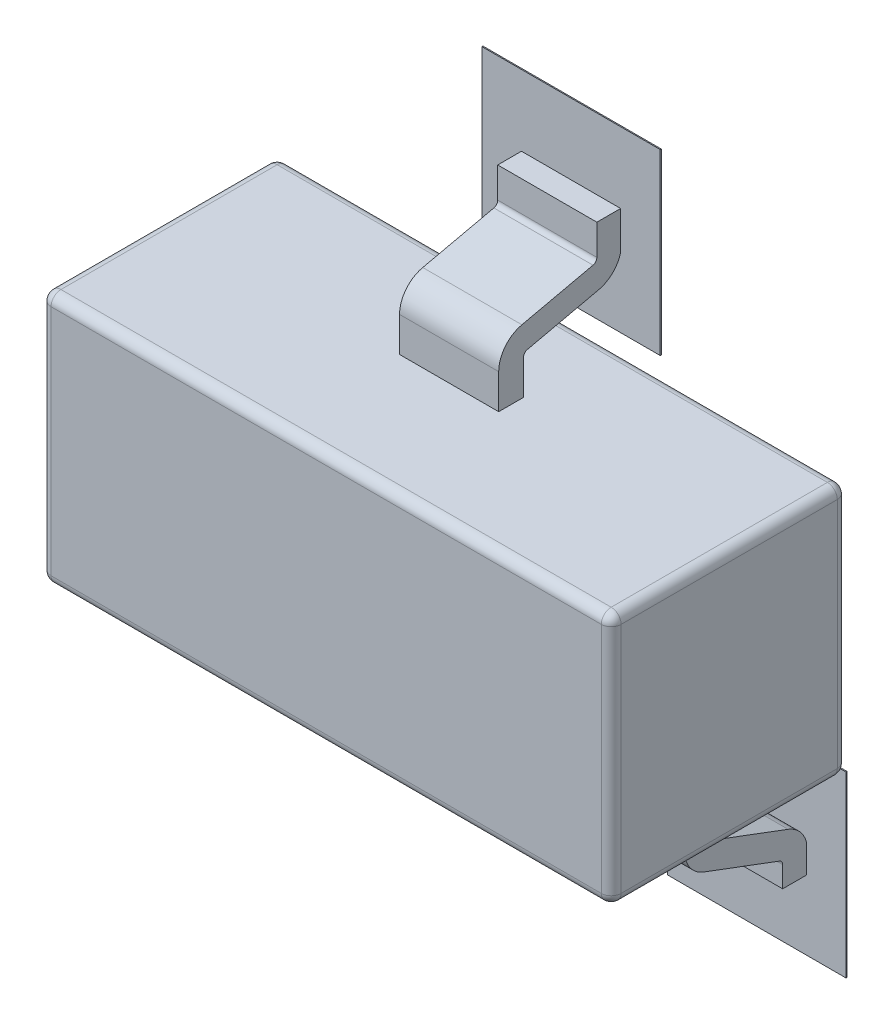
ISO-10303-21;
HEADER;
FILE_DESCRIPTION(('STEP AP214'),'2;1');
FILE_NAME('part.step','',(''),(''),'','','');
FILE_SCHEMA(('AUTOMOTIVE_DESIGN { 1 0 10303 214 1 1 1 1 }'));
ENDSEC;
DATA;
#1=APPLICATION_CONTEXT('core data for automotive mechanical design processes');
#2=APPLICATION_PROTOCOL_DEFINITION('international standard','automotive_design',2000,#1);
#3=PRODUCT_CONTEXT('',#1,'mechanical');
#4=PRODUCT('Part','Part','',(#3));
#5=PRODUCT_RELATED_PRODUCT_CATEGORY('part','',(#4));
#6=PRODUCT_DEFINITION_FORMATION('','',#4);
#7=PRODUCT_DEFINITION_CONTEXT('part definition',#1,'design');
#8=PRODUCT_DEFINITION('design','',#6,#7);
#9=PRODUCT_DEFINITION_SHAPE('','',#8);
#10=(LENGTH_UNIT() NAMED_UNIT(*) SI_UNIT(.MILLI.,.METRE.));
#11=(NAMED_UNIT(*) PLANE_ANGLE_UNIT() SI_UNIT($,.RADIAN.));
#12=(NAMED_UNIT(*) SI_UNIT($,.STERADIAN.) SOLID_ANGLE_UNIT());
#13=UNCERTAINTY_MEASURE_WITH_UNIT(LENGTH_MEASURE(1.E-05),#10,'distance_accuracy_value','');
#14=(GEOMETRIC_REPRESENTATION_CONTEXT(3) GLOBAL_UNCERTAINTY_ASSIGNED_CONTEXT((#13)) GLOBAL_UNIT_ASSIGNED_CONTEXT((#10,
#11,#12)) REPRESENTATION_CONTEXT('',''));
#15=CARTESIAN_POINT('',(0.,0.,0.));
#16=DIRECTION('',(0.,0.,1.));
#17=DIRECTION('',(1.,0.,0.));
#18=AXIS2_PLACEMENT_3D('',#15,#16,#17);
#19=CARTESIAN_POINT('',(1.205992,-1.2450064,0.0762));
#20=DIRECTION('',(0.,0.,-1.));
#21=DIRECTION('',(-1.,0.,0.));
#22=AXIS2_PLACEMENT_3D('',#19,#20,#21);
#23=PLANE('',#22);
#24=DIRECTION('',(1.,0.,0.));
#25=VECTOR('',#24,1.);
#26=CARTESIAN_POINT('',(0.4569968,1.5999968,0.0762));
#27=LINE('',#26,#25);
#28=CARTESIAN_POINT('',(0.4569968,1.5999968,0.0762));
#29=VERTEX_POINT('',#28);
#30=CARTESIAN_POINT('',(-0.4569968,1.5999968,0.0762));
#31=VERTEX_POINT('',#30);
#32=EDGE_CURVE('E717',#29,#31,#27,.F.);
#33=ORIENTED_EDGE('',*,*,#32,.F.);
#34=DIRECTION('',(0.,1.,0.));
#35=VECTOR('',#34,1.);
#36=CARTESIAN_POINT('',(0.4569968,0.6860032,0.0762));
#37=LINE('',#36,#35);
#38=CARTESIAN_POINT('',(0.4569968,0.6860032,0.0762));
#39=VERTEX_POINT('',#38);
#40=EDGE_CURVE('E698',#39,#29,#37,.T.);
#41=ORIENTED_EDGE('',*,*,#40,.F.);
#42=DIRECTION('',(1.,0.,0.));
#43=VECTOR('',#42,1.);
#44=CARTESIAN_POINT('',(-0.4569968,0.6860032,0.0762));
#45=LINE('',#44,#43);
#46=CARTESIAN_POINT('',(-0.4569968,0.6860032,0.0762));
#47=VERTEX_POINT('',#46);
#48=EDGE_CURVE('E707',#47,#39,#45,.T.);
#49=ORIENTED_EDGE('',*,*,#48,.F.);
#50=DIRECTION('',(0.,1.,0.));
#51=VECTOR('',#50,1.);
#52=CARTESIAN_POINT('',(-0.4569968,1.5999968,0.0762));
#53=LINE('',#52,#51);
#54=EDGE_CURVE('E712',#31,#47,#53,.F.);
#55=ORIENTED_EDGE('',*,*,#54,.F.);
#56=EDGE_LOOP('',(#33,#41,#49,#55));
#57=FACE_BOUND('',#56,.T.);
#58=ADVANCED_FACE('F16',(#57),#23,.T.);
#59=CARTESIAN_POINT('',(1.205992,-1.2450064,0.0762));
#60=DIRECTION('',(0.,0.,-1.));
#61=DIRECTION('',(-1.,0.,0.));
#62=AXIS2_PLACEMENT_3D('',#59,#60,#61);
#63=PLANE('',#62);
#64=DIRECTION('',(1.,0.,0.));
#65=VECTOR('',#64,1.);
#66=CARTESIAN_POINT('',(1.4089888,-0.6860032,0.0762));
#67=LINE('',#66,#65);
#68=CARTESIAN_POINT('',(1.4089888,-0.6860032,0.0762));
#69=VERTEX_POINT('',#68);
#70=CARTESIAN_POINT('',(0.4949952,-0.6860032,0.0762));
#71=VERTEX_POINT('',#70);
#72=EDGE_CURVE('E696',#69,#71,#67,.F.);
#73=ORIENTED_EDGE('',*,*,#72,.F.);
#74=DIRECTION('',(0.,1.,0.));
#75=VECTOR('',#74,1.);
#76=CARTESIAN_POINT('',(1.4089888,-1.5999968,0.0762));
#77=LINE('',#76,#75);
#78=CARTESIAN_POINT('',(1.4089888,-1.5999968,0.0762));
#79=VERTEX_POINT('',#78);
#80=EDGE_CURVE('E677',#79,#69,#77,.T.);
#81=ORIENTED_EDGE('',*,*,#80,.F.);
#82=DIRECTION('',(1.,0.,0.));
#83=VECTOR('',#82,1.);
#84=CARTESIAN_POINT('',(0.4949952,-1.5999968,0.0762));
#85=LINE('',#84,#83);
#86=CARTESIAN_POINT('',(0.4949952,-1.5999968,0.0762));
#87=VERTEX_POINT('',#86);
#88=EDGE_CURVE('E686',#87,#79,#85,.T.);
#89=ORIENTED_EDGE('',*,*,#88,.F.);
#90=DIRECTION('',(0.,1.,0.));
#91=VECTOR('',#90,1.);
#92=CARTESIAN_POINT('',(0.4949952,-0.6860032,0.0762));
#93=LINE('',#92,#91);
#94=EDGE_CURVE('E691',#71,#87,#93,.F.);
#95=ORIENTED_EDGE('',*,*,#94,.F.);
#96=EDGE_LOOP('',(#73,#81,#89,#95));
#97=FACE_BOUND('',#96,.T.);
#98=ADVANCED_FACE('F1296',(#97),#63,.T.);
#99=CARTESIAN_POINT('',(1.205992,-1.2450064,0.0762));
#100=DIRECTION('',(0.,0.,-1.));
#101=DIRECTION('',(-1.,0.,0.));
#102=AXIS2_PLACEMENT_3D('',#99,#100,#101);
#103=PLANE('',#102);
#104=DIRECTION('',(1.,0.,0.));
#105=VECTOR('',#104,1.);
#106=CARTESIAN_POINT('',(-0.4949952,-0.6860032,0.0762));
#107=LINE('',#106,#105);
#108=CARTESIAN_POINT('',(-0.4949952,-0.6860032,0.0762));
#109=VERTEX_POINT('',#108);
#110=CARTESIAN_POINT('',(-1.4089888,-0.6860032,0.0762));
#111=VERTEX_POINT('',#110);
#112=EDGE_CURVE('E675',#109,#111,#107,.F.);
#113=ORIENTED_EDGE('',*,*,#112,.F.);
#114=DIRECTION('',(0.,1.,0.));
#115=VECTOR('',#114,1.);
#116=CARTESIAN_POINT('',(-0.4949952,-1.5999968,0.0762));
#117=LINE('',#116,#115);
#118=CARTESIAN_POINT('',(-0.4949952,-1.5999968,0.0762));
#119=VERTEX_POINT('',#118);
#120=EDGE_CURVE('E646',#119,#109,#117,.T.);
#121=ORIENTED_EDGE('',*,*,#120,.F.);
#122=DIRECTION('',(1.,0.,0.));
#123=VECTOR('',#122,1.);
#124=CARTESIAN_POINT('',(-1.4089888,-1.5999968,0.0762));
#125=LINE('',#124,#123);
#126=CARTESIAN_POINT('',(-1.4089888,-1.5999968,0.0762));
#127=VERTEX_POINT('',#126);
#128=EDGE_CURVE('E665',#127,#119,#125,.T.);
#129=ORIENTED_EDGE('',*,*,#128,.F.);
#130=DIRECTION('',(0.,1.,0.));
#131=VECTOR('',#130,1.);
#132=CARTESIAN_POINT('',(-1.4089888,-0.6860032,0.0762));
#133=LINE('',#132,#131);
#134=EDGE_CURVE('E670',#111,#127,#133,.F.);
#135=ORIENTED_EDGE('',*,*,#134,.F.);
#136=EDGE_LOOP('',(#113,#121,#129,#135));
#137=FACE_BOUND('',#136,.T.);
#138=ADVANCED_FACE('F1293',(#137),#103,.T.);
#139=CARTESIAN_POINT('',(0.4569968,1.5999968,0.0762));
#140=DIRECTION('',(0.,1.,0.));
#141=DIRECTION('',(0.,0.,1.));
#142=AXIS2_PLACEMENT_3D('',#139,#140,#141);
#143=PLANE('',#142);
#144=DIRECTION('',(0.,0.,-1.));
#145=VECTOR('',#144,1.);
#146=CARTESIAN_POINT('',(0.4569968,1.5999968,0.0762));
#147=LINE('',#146,#145);
#148=CARTESIAN_POINT('',(0.4569968,1.5999968,0.081534));
#149=VERTEX_POINT('',#148);
#150=EDGE_CURVE('E704',#29,#149,#147,.F.);
#151=ORIENTED_EDGE('',*,*,#150,.F.);
#152=ORIENTED_EDGE('',*,*,#32,.T.);
#153=DIRECTION('',(0.,0.,1.));
#154=VECTOR('',#153,1.);
#155=CARTESIAN_POINT('',(-0.4569968,1.5999968,0.0762));
#156=LINE('',#155,#154);
#157=CARTESIAN_POINT('',(-0.4569968,1.5999968,0.081534));
#158=VERTEX_POINT('',#157);
#159=EDGE_CURVE('E714',#158,#31,#156,.F.);
#160=ORIENTED_EDGE('',*,*,#159,.F.);
#161=DIRECTION('',(1.,0.,0.));
#162=VECTOR('',#161,1.);
#163=CARTESIAN_POINT('',(0.,1.5999968,0.081534));
#164=LINE('',#163,#162);
#165=EDGE_CURVE('E643',#149,#158,#164,.F.);
#166=ORIENTED_EDGE('',*,*,#165,.F.);
#167=EDGE_LOOP('',(#151,#152,#160,#166));
#168=FACE_BOUND('',#167,.T.);
#169=ADVANCED_FACE('F1289',(#168),#143,.T.);
#170=CARTESIAN_POINT('',(-0.4569968,1.5999968,0.0762));
#171=DIRECTION('',(-1.,0.,0.));
#172=DIRECTION('',(0.,0.,1.));
#173=AXIS2_PLACEMENT_3D('',#170,#171,#172);
#174=PLANE('',#173);
#175=ORIENTED_EDGE('',*,*,#159,.T.);
#176=ORIENTED_EDGE('',*,*,#54,.T.);
#177=DIRECTION('',(0.,0.,-1.));
#178=VECTOR('',#177,1.);
#179=CARTESIAN_POINT('',(-0.4569968,0.6860032,0.0762));
#180=LINE('',#179,#178);
#181=CARTESIAN_POINT('',(-0.4569968,0.6860032,0.081534));
#182=VERTEX_POINT('',#181);
#183=EDGE_CURVE('E709',#182,#47,#180,.T.);
#184=ORIENTED_EDGE('',*,*,#183,.F.);
#185=DIRECTION('',(0.,1.,0.));
#186=VECTOR('',#185,1.);
#187=CARTESIAN_POINT('',(-0.4569968,0.,0.081534));
#188=LINE('',#187,#186);
#189=EDGE_CURVE('E640',#158,#182,#188,.F.);
#190=ORIENTED_EDGE('',*,*,#189,.F.);
#191=EDGE_LOOP('',(#175,#176,#184,#190));
#192=FACE_BOUND('',#191,.T.);
#193=ADVANCED_FACE('F1285',(#192),#174,.T.);
#194=CARTESIAN_POINT('',(-0.4569968,0.6860032,0.0762));
#195=DIRECTION('',(0.,-1.,0.));
#196=DIRECTION('',(0.,0.,-1.));
#197=AXIS2_PLACEMENT_3D('',#194,#195,#196);
#198=PLANE('',#197);
#199=ORIENTED_EDGE('',*,*,#183,.T.);
#200=ORIENTED_EDGE('',*,*,#48,.T.);
#201=DIRECTION('',(0.,0.,-1.));
#202=VECTOR('',#201,1.);
#203=CARTESIAN_POINT('',(0.4569968,0.6860032,0.0762));
#204=LINE('',#203,#202);
#205=CARTESIAN_POINT('',(0.4569968,0.6860032,0.081534));
#206=VERTEX_POINT('',#205);
#207=EDGE_CURVE('E701',#206,#39,#204,.T.);
#208=ORIENTED_EDGE('',*,*,#207,.F.);
#209=DIRECTION('',(1.,0.,0.));
#210=VECTOR('',#209,1.);
#211=CARTESIAN_POINT('',(0.,0.6860032,0.081534));
#212=LINE('',#211,#210);
#213=EDGE_CURVE('E637',#182,#206,#212,.T.);
#214=ORIENTED_EDGE('',*,*,#213,.F.);
#215=EDGE_LOOP('',(#199,#200,#208,#214));
#216=FACE_BOUND('',#215,.T.);
#217=ADVANCED_FACE('F1281',(#216),#198,.T.);
#218=CARTESIAN_POINT('',(0.4569968,0.6860032,0.0762));
#219=DIRECTION('',(1.,0.,0.));
#220=DIRECTION('',(0.,0.,-1.));
#221=AXIS2_PLACEMENT_3D('',#218,#219,#220);
#222=PLANE('',#221);
#223=ORIENTED_EDGE('',*,*,#207,.T.);
#224=ORIENTED_EDGE('',*,*,#40,.T.);
#225=ORIENTED_EDGE('',*,*,#150,.T.);
#226=DIRECTION('',(0.,1.,0.));
#227=VECTOR('',#226,1.);
#228=CARTESIAN_POINT('',(0.4569968,0.,0.081534));
#229=LINE('',#228,#227);
#230=EDGE_CURVE('E632',#206,#149,#229,.T.);
#231=ORIENTED_EDGE('',*,*,#230,.F.);
#232=EDGE_LOOP('',(#223,#224,#225,#231));
#233=FACE_BOUND('',#232,.T.);
#234=ADVANCED_FACE('F1277',(#233),#222,.T.);
#235=CARTESIAN_POINT('',(1.4089888,-0.6860032,0.0762));
#236=DIRECTION('',(0.,1.,0.));
#237=DIRECTION('',(0.,0.,1.));
#238=AXIS2_PLACEMENT_3D('',#235,#236,#237);
#239=PLANE('',#238);
#240=DIRECTION('',(0.,0.,-1.));
#241=VECTOR('',#240,1.);
#242=CARTESIAN_POINT('',(1.4089888,-0.6860032,0.0762));
#243=LINE('',#242,#241);
#244=CARTESIAN_POINT('',(1.4089888,-0.6860032,0.081534));
#245=VERTEX_POINT('',#244);
#246=EDGE_CURVE('E683',#69,#245,#243,.F.);
#247=ORIENTED_EDGE('',*,*,#246,.F.);
#248=ORIENTED_EDGE('',*,*,#72,.T.);
#249=DIRECTION('',(0.,0.,1.));
#250=VECTOR('',#249,1.);
#251=CARTESIAN_POINT('',(0.4949952,-0.6860032,0.0762));
#252=LINE('',#251,#250);
#253=CARTESIAN_POINT('',(0.4949952,-0.6860032,0.081534));
#254=VERTEX_POINT('',#253);
#255=EDGE_CURVE('E693',#254,#71,#252,.F.);
#256=ORIENTED_EDGE('',*,*,#255,.F.);
#257=DIRECTION('',(1.,0.,0.));
#258=VECTOR('',#257,1.);
#259=CARTESIAN_POINT('',(0.,-0.6860032,0.081534));
#260=LINE('',#259,#258);
#261=EDGE_CURVE('E1309',#245,#254,#260,.F.);
#262=ORIENTED_EDGE('',*,*,#261,.F.);
#263=EDGE_LOOP('',(#247,#248,#256,#262));
#264=FACE_BOUND('',#263,.T.);
#265=ADVANCED_FACE('F1273',(#264),#239,.T.);
#266=CARTESIAN_POINT('',(0.4949952,-0.6860032,0.0762));
#267=DIRECTION('',(-1.,0.,0.));
#268=DIRECTION('',(0.,0.,1.));
#269=AXIS2_PLACEMENT_3D('',#266,#267,#268);
#270=PLANE('',#269);
#271=ORIENTED_EDGE('',*,*,#255,.T.);
#272=ORIENTED_EDGE('',*,*,#94,.T.);
#273=DIRECTION('',(0.,0.,-1.));
#274=VECTOR('',#273,1.);
#275=CARTESIAN_POINT('',(0.4949952,-1.5999968,0.0762));
#276=LINE('',#275,#274);
#277=CARTESIAN_POINT('',(0.4949952,-1.5999968,0.081534));
#278=VERTEX_POINT('',#277);
#279=EDGE_CURVE('E688',#278,#87,#276,.T.);
#280=ORIENTED_EDGE('',*,*,#279,.F.);
#281=DIRECTION('',(0.,1.,0.));
#282=VECTOR('',#281,1.);
#283=CARTESIAN_POINT('',(0.4949952,0.,0.081534));
#284=LINE('',#283,#282);
#285=EDGE_CURVE('E1318',#254,#278,#284,.F.);
#286=ORIENTED_EDGE('',*,*,#285,.F.);
#287=EDGE_LOOP('',(#271,#272,#280,#286));
#288=FACE_BOUND('',#287,.T.);
#289=ADVANCED_FACE('F1269',(#288),#270,.T.);
#290=CARTESIAN_POINT('',(0.4949952,-1.5999968,0.0762));
#291=DIRECTION('',(0.,-1.,0.));
#292=DIRECTION('',(0.,0.,-1.));
#293=AXIS2_PLACEMENT_3D('',#290,#291,#292);
#294=PLANE('',#293);
#295=ORIENTED_EDGE('',*,*,#279,.T.);
#296=ORIENTED_EDGE('',*,*,#88,.T.);
#297=DIRECTION('',(0.,0.,-1.));
#298=VECTOR('',#297,1.);
#299=CARTESIAN_POINT('',(1.4089888,-1.5999968,0.0762));
#300=LINE('',#299,#298);
#301=CARTESIAN_POINT('',(1.4089888,-1.5999968,0.081534));
#302=VERTEX_POINT('',#301);
#303=EDGE_CURVE('E680',#302,#79,#300,.T.);
#304=ORIENTED_EDGE('',*,*,#303,.F.);
#305=DIRECTION('',(1.,0.,0.));
#306=VECTOR('',#305,1.);
#307=CARTESIAN_POINT('',(0.,-1.5999968,0.081534));
#308=LINE('',#307,#306);
#309=EDGE_CURVE('E1315',#278,#302,#308,.T.);
#310=ORIENTED_EDGE('',*,*,#309,.F.);
#311=EDGE_LOOP('',(#295,#296,#304,#310));
#312=FACE_BOUND('',#311,.T.);
#313=ADVANCED_FACE('F1265',(#312),#294,.T.);
#314=CARTESIAN_POINT('',(1.4089888,-1.5999968,0.0762));
#315=DIRECTION('',(1.,0.,0.));
#316=DIRECTION('',(0.,0.,-1.));
#317=AXIS2_PLACEMENT_3D('',#314,#315,#316);
#318=PLANE('',#317);
#319=ORIENTED_EDGE('',*,*,#303,.T.);
#320=ORIENTED_EDGE('',*,*,#80,.T.);
#321=ORIENTED_EDGE('',*,*,#246,.T.);
#322=DIRECTION('',(0.,1.,0.));
#323=VECTOR('',#322,1.);
#324=CARTESIAN_POINT('',(1.4089888,0.,0.081534));
#325=LINE('',#324,#323);
#326=EDGE_CURVE('E1312',#302,#245,#325,.T.);
#327=ORIENTED_EDGE('',*,*,#326,.F.);
#328=EDGE_LOOP('',(#319,#320,#321,#327));
#329=FACE_BOUND('',#328,.T.);
#330=ADVANCED_FACE('F1261',(#329),#318,.T.);
#331=CARTESIAN_POINT('',(-0.4949952,-0.6860032,0.0762));
#332=DIRECTION('',(0.,1.,0.));
#333=DIRECTION('',(0.,0.,1.));
#334=AXIS2_PLACEMENT_3D('',#331,#332,#333);
#335=PLANE('',#334);
#336=DIRECTION('',(0.,0.,-1.));
#337=VECTOR('',#336,1.);
#338=CARTESIAN_POINT('',(-0.4949952,-0.6860032,0.0762));
#339=LINE('',#338,#337);
#340=CARTESIAN_POINT('',(-0.4949952,-0.6860032,0.081534));
#341=VERTEX_POINT('',#340);
#342=EDGE_CURVE('E662',#109,#341,#339,.F.);
#343=ORIENTED_EDGE('',*,*,#342,.F.);
#344=ORIENTED_EDGE('',*,*,#112,.T.);
#345=DIRECTION('',(0.,0.,1.));
#346=VECTOR('',#345,1.);
#347=CARTESIAN_POINT('',(-1.4089888,-0.6860032,0.0762));
#348=LINE('',#347,#346);
#349=CARTESIAN_POINT('',(-1.4089888,-0.6860032,0.081534));
#350=VERTEX_POINT('',#349);
#351=EDGE_CURVE('E672',#350,#111,#348,.F.);
#352=ORIENTED_EDGE('',*,*,#351,.F.);
#353=DIRECTION('',(1.,0.,0.));
#354=VECTOR('',#353,1.);
#355=CARTESIAN_POINT('',(0.,-0.6860032,0.081534));
#356=LINE('',#355,#354);
#357=EDGE_CURVE('E1331',#341,#350,#356,.F.);
#358=ORIENTED_EDGE('',*,*,#357,.F.);
#359=EDGE_LOOP('',(#343,#344,#352,#358));
#360=FACE_BOUND('',#359,.T.);
#361=ADVANCED_FACE('F1257',(#360),#335,.T.);
#362=CARTESIAN_POINT('',(-1.4089888,-0.6860032,0.0762));
#363=DIRECTION('',(-1.,0.,0.));
#364=DIRECTION('',(0.,0.,1.));
#365=AXIS2_PLACEMENT_3D('',#362,#363,#364);
#366=PLANE('',#365);
#367=ORIENTED_EDGE('',*,*,#351,.T.);
#368=ORIENTED_EDGE('',*,*,#134,.T.);
#369=DIRECTION('',(0.,0.,-1.));
#370=VECTOR('',#369,1.);
#371=CARTESIAN_POINT('',(-1.4089888,-1.5999968,0.0762));
#372=LINE('',#371,#370);
#373=CARTESIAN_POINT('',(-1.4089888,-1.5999968,0.081534));
#374=VERTEX_POINT('',#373);
#375=EDGE_CURVE('E667',#374,#127,#372,.T.);
#376=ORIENTED_EDGE('',*,*,#375,.F.);
#377=DIRECTION('',(0.,1.,0.));
#378=VECTOR('',#377,1.);
#379=CARTESIAN_POINT('',(-1.4089888,0.,0.081534));
#380=LINE('',#379,#378);
#381=EDGE_CURVE('E1431',#350,#374,#380,.F.);
#382=ORIENTED_EDGE('',*,*,#381,.F.);
#383=EDGE_LOOP('',(#367,#368,#376,#382));
#384=FACE_BOUND('',#383,.T.);
#385=ADVANCED_FACE('F1254',(#384),#366,.T.);
#386=CARTESIAN_POINT('',(-1.4089888,-1.5999968,0.0762));
#387=DIRECTION('',(0.,-1.,0.));
#388=DIRECTION('',(0.,0.,-1.));
#389=AXIS2_PLACEMENT_3D('',#386,#387,#388);
#390=PLANE('',#389);
#391=ORIENTED_EDGE('',*,*,#375,.T.);
#392=ORIENTED_EDGE('',*,*,#128,.T.);
#393=DIRECTION('',(0.,0.,-1.));
#394=VECTOR('',#393,1.);
#395=CARTESIAN_POINT('',(-0.4949952,-1.5999968,0.0762));
#396=LINE('',#395,#394);
#397=CARTESIAN_POINT('',(-0.4949952,-1.5999968,0.081534));
#398=VERTEX_POINT('',#397);
#399=EDGE_CURVE('E60',#398,#119,#396,.T.);
#400=ORIENTED_EDGE('',*,*,#399,.F.);
#401=DIRECTION('',(1.,0.,0.));
#402=VECTOR('',#401,1.);
#403=CARTESIAN_POINT('',(0.,-1.5999968,0.081534));
#404=LINE('',#403,#402);
#405=EDGE_CURVE('E1428',#374,#398,#404,.T.);
#406=ORIENTED_EDGE('',*,*,#405,.F.);
#407=EDGE_LOOP('',(#391,#392,#400,#406));
#408=FACE_BOUND('',#407,.T.);
#409=ADVANCED_FACE('F1250',(#408),#390,.T.);
#410=CARTESIAN_POINT('',(-0.4949952,-1.5999968,0.0762));
#411=DIRECTION('',(1.,0.,0.));
#412=DIRECTION('',(0.,0.,-1.));
#413=AXIS2_PLACEMENT_3D('',#410,#411,#412);
#414=PLANE('',#413);
#415=ORIENTED_EDGE('',*,*,#399,.T.);
#416=ORIENTED_EDGE('',*,*,#120,.T.);
#417=ORIENTED_EDGE('',*,*,#342,.T.);
#418=DIRECTION('',(0.,1.,0.));
#419=VECTOR('',#418,1.);
#420=CARTESIAN_POINT('',(-0.4949952,0.,0.081534));
#421=LINE('',#420,#419);
#422=EDGE_CURVE('E1425',#398,#341,#421,.T.);
#423=ORIENTED_EDGE('',*,*,#422,.F.);
#424=EDGE_LOOP('',(#415,#416,#417,#423));
#425=FACE_BOUND('',#424,.T.);
#426=ADVANCED_FACE('F1246',(#425),#414,.T.);
#427=CARTESIAN_POINT('',(0.,0.,0.081534));
#428=DIRECTION('',(0.,0.,1.));
#429=DIRECTION('',(1.,0.,0.));
#430=AXIS2_PLACEMENT_3D('',#427,#428,#429);
#431=PLANE('',#430);
#432=DIRECTION('',(1.,0.,0.));
#433=VECTOR('',#432,1.);
#434=CARTESIAN_POINT('',(-0.254,1.04110441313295,0.0815339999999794));
#435=LINE('',#434,#433);
#436=CARTESIAN_POINT('',(-0.254,1.04110441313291,0.0815339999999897));
#437=VERTEX_POINT('',#436);
#438=CARTESIAN_POINT('',(0.254,1.04110441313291,0.0815339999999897));
#439=VERTEX_POINT('',#438);
#440=EDGE_CURVE('E579',#437,#439,#435,.T.);
#441=ORIENTED_EDGE('',*,*,#440,.F.);
#442=DIRECTION('',(0.,1.,0.));
#443=VECTOR('',#442,1.);
#444=CARTESIAN_POINT('',(-0.254,0.,0.081534));
#445=LINE('',#444,#443);
#446=CARTESIAN_POINT('',(-0.254,1.23720111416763,0.081534));
#447=VERTEX_POINT('',#446);
#448=EDGE_CURVE('E611',#437,#447,#445,.T.);
#449=ORIENTED_EDGE('',*,*,#448,.T.);
#450=DIRECTION('',(1.,0.,0.));
#451=VECTOR('',#450,1.);
#452=CARTESIAN_POINT('',(-0.254,1.23720111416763,0.081534));
#453=LINE('',#452,#451);
#454=CARTESIAN_POINT('',(0.254,1.23720111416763,0.081534));
#455=VERTEX_POINT('',#454);
#456=EDGE_CURVE('E622',#455,#447,#453,.F.);
#457=ORIENTED_EDGE('',*,*,#456,.F.);
#458=DIRECTION('',(0.,1.,0.));
#459=VECTOR('',#458,1.);
#460=CARTESIAN_POINT('',(0.254,0.,0.081534));
#461=LINE('',#460,#459);
#462=EDGE_CURVE('E649',#439,#455,#461,.T.);
#463=ORIENTED_EDGE('',*,*,#462,.F.);
#464=EDGE_LOOP('',(#441,#449,#457,#463));
#465=FACE_BOUND('',#464,.T.);
#466=ORIENTED_EDGE('',*,*,#213,.T.);
#467=ORIENTED_EDGE('',*,*,#230,.T.);
#468=ORIENTED_EDGE('',*,*,#165,.T.);
#469=ORIENTED_EDGE('',*,*,#189,.T.);
#470=EDGE_LOOP('',(#466,#467,#468,#469));
#471=FACE_BOUND('',#470,.T.);
#472=ADVANCED_FACE('F1242',(#465,#471),#431,.T.);
#473=CARTESIAN_POINT('',(-0.254,1.23720111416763,0.0762));
#474=DIRECTION('',(0.,1.,0.));
#475=DIRECTION('',(0.,0.,1.));
#476=AXIS2_PLACEMENT_3D('',#473,#474,#475);
#477=PLANE('',#476);
#478=DIRECTION('',(0.,0.,-1.));
#479=VECTOR('',#478,1.);
#480=CARTESIAN_POINT('',(0.254,1.23720111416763,0.));
#481=LINE('',#480,#479);
#482=CARTESIAN_POINT('',(0.254,1.23720111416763,0.2032));
#483=VERTEX_POINT('',#482);
#484=EDGE_CURVE('E450',#455,#483,#481,.F.);
#485=ORIENTED_EDGE('',*,*,#484,.F.);
#486=ORIENTED_EDGE('',*,*,#456,.T.);
#487=DIRECTION('',(0.,0.,-1.));
#488=VECTOR('',#487,1.);
#489=CARTESIAN_POINT('',(-0.254,1.23720111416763,0.));
#490=LINE('',#489,#488);
#491=CARTESIAN_POINT('',(-0.254,1.23720111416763,0.2032));
#492=VERTEX_POINT('',#491);
#493=EDGE_CURVE('E625',#447,#492,#490,.F.);
#494=ORIENTED_EDGE('',*,*,#493,.T.);
#495=DIRECTION('',(1.,0.,0.));
#496=VECTOR('',#495,1.);
#497=CARTESIAN_POINT('',(-0.254,1.23720111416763,0.2032));
#498=LINE('',#497,#496);
#499=EDGE_CURVE('E619',#483,#492,#498,.F.);
#500=ORIENTED_EDGE('',*,*,#499,.F.);
#501=EDGE_LOOP('',(#485,#486,#494,#500));
#502=FACE_BOUND('',#501,.T.);
#503=ADVANCED_FACE('F1239',(#502),#477,.T.);
#504=CARTESIAN_POINT('',(-0.254,1.23720111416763,0.2032));
#505=DIRECTION('',(0.,0.,1.));
#506=DIRECTION('',(1.,0.,0.));
#507=AXIS2_PLACEMENT_3D('',#504,#505,#506);
#508=PLANE('',#507);
#509=ORIENTED_EDGE('',*,*,#499,.T.);
#510=DIRECTION('',(0.,1.,0.));
#511=VECTOR('',#510,1.);
#512=CARTESIAN_POINT('',(-0.254,0.,0.2032));
#513=LINE('',#512,#511);
#514=CARTESIAN_POINT('',(-0.254,1.08107129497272,0.2032));
#515=VERTEX_POINT('',#514);
#516=EDGE_CURVE('E627',#492,#515,#513,.F.);
#517=ORIENTED_EDGE('',*,*,#516,.T.);
#518=DIRECTION('',(1.,0.,0.));
#519=VECTOR('',#518,1.);
#520=CARTESIAN_POINT('',(-0.254,1.08107129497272,0.2032));
#521=LINE('',#520,#519);
#522=CARTESIAN_POINT('',(0.254,1.08107129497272,0.2032));
#523=VERTEX_POINT('',#522);
#524=EDGE_CURVE('E420',#515,#523,#521,.T.);
#525=ORIENTED_EDGE('',*,*,#524,.T.);
#526=DIRECTION('',(0.,1.,0.));
#527=VECTOR('',#526,1.);
#528=CARTESIAN_POINT('',(0.254,0.,0.2032));
#529=LINE('',#528,#527);
#530=EDGE_CURVE('E448',#483,#523,#529,.F.);
#531=ORIENTED_EDGE('',*,*,#530,.F.);
#532=EDGE_LOOP('',(#509,#517,#525,#531));
#533=FACE_BOUND('',#532,.T.);
#534=ADVANCED_FACE('F1236',(#533),#508,.T.);
#535=CARTESIAN_POINT('',(-0.254,1.08107129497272,0.2286));
#536=DIRECTION('',(1.,0.,0.));
#537=DIRECTION('',(0.,0.,-1.));
#538=AXIS2_PLACEMENT_3D('',#535,#536,#537);
#539=CYLINDRICAL_SURFACE('',#538,0.0254);
#540=CARTESIAN_POINT('',(0.254,1.08107129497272,0.2286));
#541=DIRECTION('',(1.,0.,0.));
#542=DIRECTION('',(0.,0.,-1.));
#543=AXIS2_PLACEMENT_3D('',#540,#541,#542);
#544=CIRCLE('',#543,0.0254);
#545=CARTESIAN_POINT('',(0.254,1.05629293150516,0.223014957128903));
#546=VERTEX_POINT('',#545);
#547=EDGE_CURVE('E429',#523,#546,#544,.F.);
#548=ORIENTED_EDGE('',*,*,#547,.F.);
#549=ORIENTED_EDGE('',*,*,#524,.F.);
#550=CARTESIAN_POINT('',(-0.254,1.08107129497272,0.2286));
#551=DIRECTION('',(1.,0.,0.));
#552=DIRECTION('',(0.,0.,-1.));
#553=AXIS2_PLACEMENT_3D('',#550,#551,#552);
#554=CIRCLE('',#553,0.0254);
#555=CARTESIAN_POINT('',(-0.254,1.05629293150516,0.223014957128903));
#556=VERTEX_POINT('',#555);
#557=EDGE_CURVE('E432',#515,#556,#554,.F.);
#558=ORIENTED_EDGE('',*,*,#557,.T.);
#559=DIRECTION('',(1.,0.,0.));
#560=VECTOR('',#559,1.);
#561=CARTESIAN_POINT('',(-0.254,1.05629293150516,0.223014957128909));
#562=LINE('',#561,#560);
#563=EDGE_CURVE('E425',#546,#556,#562,.F.);
#564=ORIENTED_EDGE('',*,*,#563,.F.);
#565=EDGE_LOOP('',(#548,#549,#558,#564));
#566=FACE_BOUND('',#565,.T.);
#567=ADVANCED_FACE('F427',(#566),#539,.F.);
#568=CARTESIAN_POINT('',(-0.254,1.05629293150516,0.223014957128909));
#569=DIRECTION('',(0.,0.9755261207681,0.2198835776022));
#570=DIRECTION('',(0.,-0.2198835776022,0.9755261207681));
#571=AXIS2_PLACEMENT_3D('',#568,#569,#570);
#572=PLANE('',#571);
#573=ORIENTED_EDGE('',*,*,#563,.T.);
#574=DIRECTION('',(0.,-0.219883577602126,0.975526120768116));
#575=VECTOR('',#574,1.);
#576=CARTESIAN_POINT('',(-0.254,1.05629293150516,0.223014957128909));
#577=LINE('',#576,#575);
#578=CARTESIAN_POINT('',(-0.254,0.974170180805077,0.587357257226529));
#579=VERTEX_POINT('',#578);
#580=EDGE_CURVE('E870',#556,#579,#577,.T.);
#581=ORIENTED_EDGE('',*,*,#580,.T.);
#582=DIRECTION('',(1.,0.,0.));
#583=VECTOR('',#582,1.);
#584=CARTESIAN_POINT('',(-0.254,0.974170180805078,0.58735725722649));
#585=LINE('',#584,#583);
#586=CARTESIAN_POINT('',(0.254,0.974170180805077,0.587357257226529));
#587=VERTEX_POINT('',#586);
#588=EDGE_CURVE('E435',#587,#579,#585,.F.);
#589=ORIENTED_EDGE('',*,*,#588,.F.);
#590=DIRECTION('',(0.,-0.219883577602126,0.975526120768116));
#591=VECTOR('',#590,1.);
#592=CARTESIAN_POINT('',(0.254,1.05629293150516,0.223014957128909));
#593=LINE('',#592,#591);
#594=EDGE_CURVE('E438',#546,#587,#593,.T.);
#595=ORIENTED_EDGE('',*,*,#594,.F.);
#596=EDGE_LOOP('',(#573,#581,#589,#595));
#597=FACE_BOUND('',#596,.T.);
#598=ADVANCED_FACE('F439',(#597),#572,.T.);
#599=CARTESIAN_POINT('',(-0.254,0.8255,0.553847));
#600=DIRECTION('',(1.,0.,0.));
#601=DIRECTION('',(0.,0.,-1.));
#602=AXIS2_PLACEMENT_3D('',#599,#600,#601);
#603=CYLINDRICAL_SURFACE('',#602,0.1524);
#604=ORIENTED_EDGE('',*,*,#588,.T.);
#605=CARTESIAN_POINT('',(-0.254,0.8255,0.553847));
#606=DIRECTION('',(1.,0.,0.));
#607=DIRECTION('',(0.,0.,-1.));
#608=AXIS2_PLACEMENT_3D('',#605,#606,#607);
#609=CIRCLE('',#608,0.1524);
#610=CARTESIAN_POINT('',(-0.254,0.8255,0.706247));
#611=VERTEX_POINT('',#610);
#612=EDGE_CURVE('E867',#579,#611,#609,.T.);
#613=ORIENTED_EDGE('',*,*,#612,.T.);
#614=DIRECTION('',(1.,0.,0.));
#615=VECTOR('',#614,1.);
#616=CARTESIAN_POINT('',(-0.254,0.8255,0.706247));
#617=LINE('',#616,#615);
#618=CARTESIAN_POINT('',(0.254,0.8255,0.706247));
#619=VERTEX_POINT('',#618);
#620=EDGE_CURVE('E608',#619,#611,#617,.F.);
#621=ORIENTED_EDGE('',*,*,#620,.F.);
#622=CARTESIAN_POINT('',(0.254,0.8255,0.553847));
#623=DIRECTION('',(1.,0.,0.));
#624=DIRECTION('',(0.,0.,-1.));
#625=AXIS2_PLACEMENT_3D('',#622,#623,#624);
#626=CIRCLE('',#625,0.1524);
#627=EDGE_CURVE('E443',#587,#619,#626,.T.);
#628=ORIENTED_EDGE('',*,*,#627,.F.);
#629=EDGE_LOOP('',(#604,#613,#621,#628));
#630=FACE_BOUND('',#629,.T.);
#631=ADVANCED_FACE('F1227',(#630),#603,.T.);
#632=CARTESIAN_POINT('',(-0.254,0.8255,0.553847));
#633=DIRECTION('',(1.,0.,0.));
#634=DIRECTION('',(0.,0.,-1.));
#635=AXIS2_PLACEMENT_3D('',#632,#633,#634);
#636=CYLINDRICAL_SURFACE('',#635,0.0254);
#637=CARTESIAN_POINT('',(0.254,0.8255,0.553847));
#638=DIRECTION('',(1.,0.,0.));
#639=DIRECTION('',(0.,0.,-1.));
#640=AXIS2_PLACEMENT_3D('',#637,#638,#639);
#641=CIRCLE('',#640,0.0254);
#642=CARTESIAN_POINT('',(0.254,0.8255,0.579247));
#643=VERTEX_POINT('',#642);
#644=CARTESIAN_POINT('',(0.254,0.850278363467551,0.559432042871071));
#645=VERTEX_POINT('',#644);
#646=EDGE_CURVE('E874',#643,#645,#641,.F.);
#647=ORIENTED_EDGE('',*,*,#646,.F.);
#648=DIRECTION('',(-1.,0.,0.));
#649=VECTOR('',#648,1.);
#650=CARTESIAN_POINT('',(-0.254,0.8255,0.579247));
#651=LINE('',#650,#649);
#652=CARTESIAN_POINT('',(-0.254,0.8255,0.579247));
#653=VERTEX_POINT('',#652);
#654=EDGE_CURVE('E458',#653,#643,#651,.F.);
#655=ORIENTED_EDGE('',*,*,#654,.F.);
#656=CARTESIAN_POINT('',(-0.254,0.8255,0.553847));
#657=DIRECTION('',(1.,0.,0.));
#658=DIRECTION('',(0.,0.,-1.));
#659=AXIS2_PLACEMENT_3D('',#656,#657,#658);
#660=CIRCLE('',#659,0.0254);
#661=CARTESIAN_POINT('',(-0.254,0.850278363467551,0.559432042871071));
#662=VERTEX_POINT('',#661);
#663=EDGE_CURVE('E864',#653,#662,#660,.F.);
#664=ORIENTED_EDGE('',*,*,#663,.T.);
#665=DIRECTION('',(1.,0.,0.));
#666=VECTOR('',#665,1.);
#667=CARTESIAN_POINT('',(-0.254,0.850278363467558,0.55943204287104));
#668=LINE('',#667,#666);
#669=EDGE_CURVE('E589',#645,#662,#668,.F.);
#670=ORIENTED_EDGE('',*,*,#669,.F.);
#671=EDGE_LOOP('',(#647,#655,#664,#670));
#672=FACE_BOUND('',#671,.T.);
#673=ADVANCED_FACE('F1221',(#672),#636,.F.);
#674=CARTESIAN_POINT('',(-0.254,0.850278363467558,0.55943204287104));
#675=DIRECTION('',(0.,-0.9755261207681,-0.2198835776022));
#676=DIRECTION('',(0.,0.2198835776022,-0.9755261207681));
#677=AXIS2_PLACEMENT_3D('',#674,#675,#676);
#678=PLANE('',#677);
#679=ORIENTED_EDGE('',*,*,#669,.T.);
#680=DIRECTION('',(0.,0.219883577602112,-0.97552612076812));
#681=VECTOR('',#680,1.);
#682=CARTESIAN_POINT('',(-0.254,0.850278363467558,0.55943204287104));
#683=LINE('',#682,#681);
#684=CARTESIAN_POINT('',(-0.254,0.932401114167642,0.195089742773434));
#685=VERTEX_POINT('',#684);
#686=EDGE_CURVE('E863',#662,#685,#683,.T.);
#687=ORIENTED_EDGE('',*,*,#686,.T.);
#688=DIRECTION('',(1.,0.,0.));
#689=VECTOR('',#688,1.);
#690=CARTESIAN_POINT('',(-0.254,0.932401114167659,0.195089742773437));
#691=LINE('',#690,#689);
#692=CARTESIAN_POINT('',(0.254,0.932401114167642,0.195089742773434));
#693=VERTEX_POINT('',#692);
#694=EDGE_CURVE('E586',#693,#685,#691,.F.);
#695=ORIENTED_EDGE('',*,*,#694,.F.);
#696=DIRECTION('',(0.,0.219883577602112,-0.97552612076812));
#697=VECTOR('',#696,1.);
#698=CARTESIAN_POINT('',(0.254,0.850278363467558,0.55943204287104));
#699=LINE('',#698,#697);
#700=EDGE_CURVE('E873',#645,#693,#699,.T.);
#701=ORIENTED_EDGE('',*,*,#700,.F.);
#702=EDGE_LOOP('',(#679,#687,#695,#701));
#703=FACE_BOUND('',#702,.T.);
#704=ADVANCED_FACE('F1216',(#703),#678,.T.);
#705=CARTESIAN_POINT('',(-0.254,1.08107129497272,0.2286));
#706=DIRECTION('',(1.,0.,0.));
#707=DIRECTION('',(0.,0.,-1.));
#708=AXIS2_PLACEMENT_3D('',#705,#706,#707);
#709=CYLINDRICAL_SURFACE('',#708,0.1524);
#710=CARTESIAN_POINT('',(-0.254,1.08107129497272,0.2286));
#711=DIRECTION('',(1.,0.,0.));
#712=DIRECTION('',(0.,0.,-1.));
#713=AXIS2_PLACEMENT_3D('',#710,#711,#712);
#714=CIRCLE('',#713,0.1524);
#715=EDGE_CURVE('E860',#685,#437,#714,.T.);
#716=ORIENTED_EDGE('',*,*,#715,.T.);
#717=ORIENTED_EDGE('',*,*,#440,.T.);
#718=CARTESIAN_POINT('',(0.254,1.08107129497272,0.2286));
#719=DIRECTION('',(1.,0.,0.));
#720=DIRECTION('',(0.,0.,-1.));
#721=AXIS2_PLACEMENT_3D('',#718,#719,#720);
#722=CIRCLE('',#721,0.1524);
#723=EDGE_CURVE('E872',#693,#439,#722,.T.);
#724=ORIENTED_EDGE('',*,*,#723,.F.);
#725=ORIENTED_EDGE('',*,*,#694,.T.);
#726=EDGE_LOOP('',(#716,#717,#724,#725));
#727=FACE_BOUND('',#726,.T.);
#728=ADVANCED_FACE('F1212',(#727),#709,.T.);
#729=CARTESIAN_POINT('',(-1.4097,0.5969,0.1778));
#730=DIRECTION('',(-0.707106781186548,0.,-0.707106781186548));
#731=DIRECTION('',(0.,1.,0.));
#732=AXIS2_PLACEMENT_3D('',#729,#730,#731);
#733=SPHERICAL_SURFACE('',#732,0.0508);
#734=CARTESIAN_POINT('',(-1.4097,0.5969,0.1778));
#735=DIRECTION('',(0.,-1.,0.));
#736=DIRECTION('',(0.,0.,-1.));
#737=AXIS2_PLACEMENT_3D('',#734,#735,#736);
#738=CIRCLE('',#737,0.0508);
#739=CARTESIAN_POINT('',(-1.4605,0.5969,0.1778));
#740=VERTEX_POINT('',#739);
#741=CARTESIAN_POINT('',(-1.44562102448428,0.5969,0.141878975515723));
#742=VERTEX_POINT('',#741);
#743=EDGE_CURVE('E856',#740,#742,#738,.T.);
#744=ORIENTED_EDGE('',*,*,#743,.F.);
#745=CARTESIAN_POINT('',(-1.4097,0.5969,0.1778));
#746=DIRECTION('',(0.,0.,-1.));
#747=DIRECTION('',(-1.,0.,0.));
#748=AXIS2_PLACEMENT_3D('',#745,#746,#747);
#749=CIRCLE('',#748,0.0508);
#750=CARTESIAN_POINT('',(-1.4097,0.6477,0.1778));
#751=VERTEX_POINT('',#750);
#752=EDGE_CURVE('E857',#751,#740,#749,.F.);
#753=ORIENTED_EDGE('',*,*,#752,.F.);
#754=CARTESIAN_POINT('',(-1.4097,0.5969,0.1778));
#755=DIRECTION('',(-1.,0.,0.));
#756=DIRECTION('',(0.,0.,1.));
#757=AXIS2_PLACEMENT_3D('',#754,#755,#756);
#758=CIRCLE('',#757,0.0508);
#759=CARTESIAN_POINT('',(-1.4097,0.5969,0.127));
#760=VERTEX_POINT('',#759);
#761=EDGE_CURVE('E19',#760,#751,#758,.F.);
#762=ORIENTED_EDGE('',*,*,#761,.F.);
#763=CARTESIAN_POINT('',(-1.4097,0.5969,0.1778));
#764=DIRECTION('',(0.,-1.,0.));
#765=DIRECTION('',(0.,0.,-1.));
#766=AXIS2_PLACEMENT_3D('',#763,#764,#765);
#767=CIRCLE('',#766,0.0508);
#768=EDGE_CURVE('E583',#742,#760,#767,.T.);
#769=ORIENTED_EDGE('',*,*,#768,.F.);
#770=EDGE_LOOP('',(#744,#753,#762,#769));
#771=FACE_BOUND('',#770,.T.);
#772=ADVANCED_FACE('F562',(#771),#733,.T.);
#773=CARTESIAN_POINT('',(-1.4097,-0.5969,0.1778));
#774=DIRECTION('',(0.,-0.707106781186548,-0.707106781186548));
#775=DIRECTION('',(-1.,0.,0.));
#776=AXIS2_PLACEMENT_3D('',#773,#774,#775);
#777=SPHERICAL_SURFACE('',#776,0.0508);
#778=CARTESIAN_POINT('',(-1.4097,-0.5969,0.1778));
#779=DIRECTION('',(1.,0.,0.));
#780=DIRECTION('',(0.,0.,-1.));
#781=AXIS2_PLACEMENT_3D('',#778,#779,#780);
#782=CIRCLE('',#781,0.0508);
#783=CARTESIAN_POINT('',(-1.4097,-0.632821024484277,0.141878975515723));
#784=VERTEX_POINT('',#783);
#785=CARTESIAN_POINT('',(-1.4097,-0.5969,0.127));
#786=VERTEX_POINT('',#785);
#787=EDGE_CURVE('E575',#784,#786,#782,.T.);
#788=ORIENTED_EDGE('',*,*,#787,.F.);
#789=CARTESIAN_POINT('',(-1.4097,-0.5969,0.1778));
#790=DIRECTION('',(1.,0.,0.));
#791=DIRECTION('',(0.,0.,-1.));
#792=AXIS2_PLACEMENT_3D('',#789,#790,#791);
#793=CIRCLE('',#792,0.0508);
#794=CARTESIAN_POINT('',(-1.4097,-0.6477,0.1778));
#795=VERTEX_POINT('',#794);
#796=EDGE_CURVE('E846',#795,#784,#793,.T.);
#797=ORIENTED_EDGE('',*,*,#796,.F.);
#798=CARTESIAN_POINT('',(-1.4097,-0.5969,0.1778));
#799=DIRECTION('',(0.,0.,-1.));
#800=DIRECTION('',(-1.,0.,0.));
#801=AXIS2_PLACEMENT_3D('',#798,#799,#800);
#802=CIRCLE('',#801,0.0508);
#803=CARTESIAN_POINT('',(-1.4605,-0.5969,0.1778));
#804=VERTEX_POINT('',#803);
#805=EDGE_CURVE('E850',#804,#795,#802,.F.);
#806=ORIENTED_EDGE('',*,*,#805,.F.);
#807=CARTESIAN_POINT('',(-1.4097,-0.5969,0.1778));
#808=DIRECTION('',(0.,-1.,0.));
#809=DIRECTION('',(0.,0.,-1.));
#810=AXIS2_PLACEMENT_3D('',#807,#808,#809);
#811=CIRCLE('',#810,0.0508);
#812=EDGE_CURVE('E582',#786,#804,#811,.F.);
#813=ORIENTED_EDGE('',*,*,#812,.F.);
#814=EDGE_LOOP('',(#788,#797,#806,#813));
#815=FACE_BOUND('',#814,.T.);
#816=ADVANCED_FACE('F557',(#815),#777,.T.);
#817=CARTESIAN_POINT('',(0.,0.,0.127));
#818=DIRECTION('',(0.,0.,1.));
#819=DIRECTION('',(1.,0.,0.));
#820=AXIS2_PLACEMENT_3D('',#817,#818,#819);
#821=PLANE('',#820);
#822=DIRECTION('',(0.,1.,0.));
#823=VECTOR('',#822,1.);
#824=CARTESIAN_POINT('',(1.4097,0.,0.127));
#825=LINE('',#824,#823);
#826=CARTESIAN_POINT('',(1.4097,-0.5969,0.127));
#827=VERTEX_POINT('',#826);
#828=CARTESIAN_POINT('',(1.4097,0.5969,0.127));
#829=VERTEX_POINT('',#828);
#830=EDGE_CURVE('E576',#827,#829,#825,.T.);
#831=ORIENTED_EDGE('',*,*,#830,.F.);
#832=DIRECTION('',(1.,0.,0.));
#833=VECTOR('',#832,1.);
#834=CARTESIAN_POINT('',(-5.4973728,-0.5969,0.127));
#835=LINE('',#834,#833);
#836=EDGE_CURVE('E571',#786,#827,#835,.T.);
#837=ORIENTED_EDGE('',*,*,#836,.F.);
#838=DIRECTION('',(0.,-1.,0.));
#839=VECTOR('',#838,1.);
#840=CARTESIAN_POINT('',(-1.4097,5.77150845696,0.127));
#841=LINE('',#840,#839);
#842=EDGE_CURVE('E580',#760,#786,#841,.T.);
#843=ORIENTED_EDGE('',*,*,#842,.F.);
#844=DIRECTION('',(-1.,0.,0.));
#845=VECTOR('',#844,1.);
#846=CARTESIAN_POINT('',(5.4973728,0.5969,0.127));
#847=LINE('',#846,#845);
#848=EDGE_CURVE('E454',#829,#760,#847,.T.);
#849=ORIENTED_EDGE('',*,*,#848,.F.);
#850=EDGE_LOOP('',(#831,#837,#843,#849));
#851=FACE_BOUND('',#850,.T.);
#852=ADVANCED_FACE('F553',(#851),#821,.F.);
#853=CARTESIAN_POINT('',(1.205992,-1.13749624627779,0.2286));
#854=DIRECTION('',(1.,0.,0.));
#855=DIRECTION('',(0.,0.,-1.));
#856=AXIS2_PLACEMENT_3D('',#853,#854,#855);
#857=CYLINDRICAL_SURFACE('',#856,0.1524);
#858=CARTESIAN_POINT('',(1.205992,-1.13749624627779,0.2286));
#859=DIRECTION('',(1.,0.,0.));
#860=DIRECTION('',(0.,0.,-1.));
#861=AXIS2_PLACEMENT_3D('',#858,#859,#860);
#862=CIRCLE('',#861,0.1524);
#863=CARTESIAN_POINT('',(1.205992,-1.09752936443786,0.081534));
#864=VERTEX_POINT('',#863);
#865=CARTESIAN_POINT('',(1.205992,-0.994816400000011,0.175044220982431));
#866=VERTEX_POINT('',#865);
#867=EDGE_CURVE('E827',#864,#866,#862,.T.);
#868=ORIENTED_EDGE('',*,*,#867,.F.);
#869=DIRECTION('',(1.,0.,0.));
#870=VECTOR('',#869,1.);
#871=CARTESIAN_POINT('',(0.,-1.09752936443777,0.081534));
#872=LINE('',#871,#870);
#873=CARTESIAN_POINT('',(0.697992,-1.09752936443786,0.081534));
#874=VERTEX_POINT('',#873);
#875=EDGE_CURVE('E1328',#874,#864,#872,.T.);
#876=ORIENTED_EDGE('',*,*,#875,.F.);
#877=CARTESIAN_POINT('',(0.697992,-1.13749624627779,0.2286));
#878=DIRECTION('',(1.,0.,0.));
#879=DIRECTION('',(0.,0.,-1.));
#880=AXIS2_PLACEMENT_3D('',#877,#878,#879);
#881=CIRCLE('',#880,0.1524);
#882=CARTESIAN_POINT('',(0.697992,-0.994816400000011,0.175044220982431));
#883=VERTEX_POINT('',#882);
#884=EDGE_CURVE('E841',#874,#883,#881,.T.);
#885=ORIENTED_EDGE('',*,*,#884,.T.);
#886=DIRECTION('',(1.,0.,0.));
#887=VECTOR('',#886,1.);
#888=CARTESIAN_POINT('',(1.205992,-0.9948164,0.175044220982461));
#889=LINE('',#888,#887);
#890=EDGE_CURVE('E578',#866,#883,#889,.F.);
#891=ORIENTED_EDGE('',*,*,#890,.F.);
#892=EDGE_LOOP('',(#868,#876,#885,#891));
#893=FACE_BOUND('',#892,.T.);
#894=ADVANCED_FACE('F549',(#893),#857,.T.);
#895=CARTESIAN_POINT('',(1.205992,-0.9948164,0.175044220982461));
#896=DIRECTION('',(0.,0.936219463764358,-0.351415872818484));
#897=DIRECTION('',(0.,0.351415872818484,0.936219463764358));
#898=AXIS2_PLACEMENT_3D('',#895,#896,#897);
#899=PLANE('',#898);
#900=DIRECTION('',(1.,0.,0.));
#901=VECTOR('',#900,1.);
#902=CARTESIAN_POINT('',(1.205992,-0.849279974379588,0.56277296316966));
#903=LINE('',#902,#901);
#904=CARTESIAN_POINT('',(0.697992,-0.849279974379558,0.562772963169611));
#905=VERTEX_POINT('',#904);
#906=CARTESIAN_POINT('',(1.205992,-0.849279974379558,0.562772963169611));
#907=VERTEX_POINT('',#906);
#908=EDGE_CURVE('E1349',#905,#907,#903,.T.);
#909=ORIENTED_EDGE('',*,*,#908,.T.);
#910=DIRECTION('',(0.,0.351415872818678,0.936219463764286));
#911=VECTOR('',#910,1.);
#912=CARTESIAN_POINT('',(1.205992,-0.9948164,0.175044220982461));
#913=LINE('',#912,#911);
#914=EDGE_CURVE('E826',#866,#907,#913,.T.);
#915=ORIENTED_EDGE('',*,*,#914,.F.);
#916=ORIENTED_EDGE('',*,*,#890,.T.);
#917=DIRECTION('',(0.,0.351415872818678,0.936219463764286));
#918=VECTOR('',#917,1.);
#919=CARTESIAN_POINT('',(0.697992,-0.9948164,0.175044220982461));
#920=LINE('',#919,#918);
#921=EDGE_CURVE('E840',#883,#905,#920,.T.);
#922=ORIENTED_EDGE('',*,*,#921,.T.);
#923=EDGE_LOOP('',(#909,#915,#916,#922));
#924=FACE_BOUND('',#923,.T.);
#925=ADVANCED_FACE('F545',(#924),#899,.T.);
#926=CARTESIAN_POINT('',(1.205992,-0.8255,0.553847));
#927=DIRECTION('',(1.,0.,0.));
#928=DIRECTION('',(0.,0.,-1.));
#929=AXIS2_PLACEMENT_3D('',#926,#927,#928);
#930=CYLINDRICAL_SURFACE('',#929,0.0254);
#931=CARTESIAN_POINT('',(0.697992,-0.8255,0.553847));
#932=DIRECTION('',(1.,0.,0.));
#933=DIRECTION('',(0.,0.,-1.));
#934=AXIS2_PLACEMENT_3D('',#931,#932,#933);
#935=CIRCLE('',#934,0.0254);
#936=CARTESIAN_POINT('',(0.697992,-0.8255,0.579247));
#937=VERTEX_POINT('',#936);
#938=EDGE_CURVE('E838',#905,#937,#935,.F.);
#939=ORIENTED_EDGE('',*,*,#938,.T.);
#940=DIRECTION('',(-1.,0.,0.));
#941=VECTOR('',#940,1.);
#942=CARTESIAN_POINT('',(1.205992,-0.8255,0.579247));
#943=LINE('',#942,#941);
#944=CARTESIAN_POINT('',(1.205992,-0.8255,0.579247));
#945=VERTEX_POINT('',#944);
#946=EDGE_CURVE('E574',#945,#937,#943,.T.);
#947=ORIENTED_EDGE('',*,*,#946,.F.);
#948=CARTESIAN_POINT('',(1.205992,-0.8255,0.553847));
#949=DIRECTION('',(1.,0.,0.));
#950=DIRECTION('',(0.,0.,-1.));
#951=AXIS2_PLACEMENT_3D('',#948,#949,#950);
#952=CIRCLE('',#951,0.0254);
#953=EDGE_CURVE('E822',#907,#945,#952,.F.);
#954=ORIENTED_EDGE('',*,*,#953,.F.);
#955=ORIENTED_EDGE('',*,*,#908,.F.);
#956=EDGE_LOOP('',(#939,#947,#954,#955));
#957=FACE_BOUND('',#956,.T.);
#958=ADVANCED_FACE('F541',(#957),#930,.F.);
#959=CARTESIAN_POINT('',(1.205992,-0.8255,0.553847));
#960=DIRECTION('',(1.,0.,0.));
#961=DIRECTION('',(0.,0.,-1.));
#962=AXIS2_PLACEMENT_3D('',#959,#960,#961);
#963=CYLINDRICAL_SURFACE('',#962,0.1524);
#964=DIRECTION('',(1.,0.,0.));
#965=VECTOR('',#964,1.);
#966=CARTESIAN_POINT('',(1.205992,-0.968179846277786,0.607402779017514));
#967=LINE('',#966,#965);
#968=CARTESIAN_POINT('',(1.205992,-0.968179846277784,0.607402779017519));
#969=VERTEX_POINT('',#968);
#970=CARTESIAN_POINT('',(0.697992,-0.968179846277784,0.607402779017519));
#971=VERTEX_POINT('',#970);
#972=EDGE_CURVE('E1346',#969,#971,#967,.F.);
#973=ORIENTED_EDGE('',*,*,#972,.F.);
#974=CARTESIAN_POINT('',(1.205992,-0.8255,0.553847));
#975=DIRECTION('',(1.,0.,0.));
#976=DIRECTION('',(0.,0.,-1.));
#977=AXIS2_PLACEMENT_3D('',#974,#975,#976);
#978=CIRCLE('',#977,0.1524);
#979=CARTESIAN_POINT('',(1.205992,-0.8255,0.706247));
#980=VERTEX_POINT('',#979);
#981=EDGE_CURVE('E818',#980,#969,#978,.T.);
#982=ORIENTED_EDGE('',*,*,#981,.F.);
#983=DIRECTION('',(1.,0.,0.));
#984=VECTOR('',#983,1.);
#985=CARTESIAN_POINT('',(1.205992,-0.8255,0.706247));
#986=LINE('',#985,#984);
#987=CARTESIAN_POINT('',(0.697992,-0.8255,0.706247));
#988=VERTEX_POINT('',#987);
#989=EDGE_CURVE('E830',#988,#980,#986,.T.);
#990=ORIENTED_EDGE('',*,*,#989,.F.);
#991=CARTESIAN_POINT('',(0.697992,-0.8255,0.553847));
#992=DIRECTION('',(1.,0.,0.));
#993=DIRECTION('',(0.,0.,-1.));
#994=AXIS2_PLACEMENT_3D('',#991,#992,#993);
#995=CIRCLE('',#994,0.1524);
#996=EDGE_CURVE('E835',#988,#971,#995,.T.);
#997=ORIENTED_EDGE('',*,*,#996,.T.);
#998=EDGE_LOOP('',(#973,#982,#990,#997));
#999=FACE_BOUND('',#998,.T.);
#1000=ADVANCED_FACE('F537',(#999),#963,.T.);
#1001=CARTESIAN_POINT('',(1.205992,-0.968179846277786,0.607402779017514));
#1002=DIRECTION('',(0.,-0.936219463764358,0.351415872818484));
#1003=DIRECTION('',(0.,-0.351415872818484,-0.936219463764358));
#1004=AXIS2_PLACEMENT_3D('',#1001,#1002,#1003);
#1005=PLANE('',#1004);
#1006=DIRECTION('',(1.,0.,0.));
#1007=VECTOR('',#1006,1.);
#1008=CARTESIAN_POINT('',(1.205992,-1.11371627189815,0.219674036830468));
#1009=LINE('',#1008,#1007);
#1010=CARTESIAN_POINT('',(0.697992,-1.1137162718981,0.21967403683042));
#1011=VERTEX_POINT('',#1010);
#1012=CARTESIAN_POINT('',(1.205992,-1.1137162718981,0.21967403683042));
#1013=VERTEX_POINT('',#1012);
#1014=EDGE_CURVE('E1344',#1011,#1013,#1009,.T.);
#1015=ORIENTED_EDGE('',*,*,#1014,.T.);
#1016=DIRECTION('',(0.,-0.351415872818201,-0.936219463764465));
#1017=VECTOR('',#1016,1.);
#1018=CARTESIAN_POINT('',(1.205992,-0.968179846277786,0.607402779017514));
#1019=LINE('',#1018,#1017);
#1020=EDGE_CURVE('E817',#969,#1013,#1019,.T.);
#1021=ORIENTED_EDGE('',*,*,#1020,.F.);
#1022=ORIENTED_EDGE('',*,*,#972,.T.);
#1023=DIRECTION('',(0.,-0.351415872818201,-0.936219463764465));
#1024=VECTOR('',#1023,1.);
#1025=CARTESIAN_POINT('',(0.697992,-0.968179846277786,0.607402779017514));
#1026=LINE('',#1025,#1024);
#1027=EDGE_CURVE('E834',#971,#1011,#1026,.T.);
#1028=ORIENTED_EDGE('',*,*,#1027,.T.);
#1029=EDGE_LOOP('',(#1015,#1021,#1022,#1028));
#1030=FACE_BOUND('',#1029,.T.);
#1031=ADVANCED_FACE('F533',(#1030),#1005,.T.);
#1032=CARTESIAN_POINT('',(1.205992,-1.13749624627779,0.2286));
#1033=DIRECTION('',(1.,0.,0.));
#1034=DIRECTION('',(0.,0.,-1.));
#1035=AXIS2_PLACEMENT_3D('',#1032,#1033,#1034);
#1036=CYLINDRICAL_SURFACE('',#1035,0.0254);
#1037=CARTESIAN_POINT('',(0.697992,-1.13749624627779,0.2286));
#1038=DIRECTION('',(1.,0.,0.));
#1039=DIRECTION('',(0.,0.,-1.));
#1040=AXIS2_PLACEMENT_3D('',#1037,#1038,#1039);
#1041=CIRCLE('',#1040,0.0254);
#1042=CARTESIAN_POINT('',(0.697992,-1.13749624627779,0.2032));
#1043=VERTEX_POINT('',#1042);
#1044=EDGE_CURVE('E831',#1011,#1043,#1041,.F.);
#1045=ORIENTED_EDGE('',*,*,#1044,.T.);
#1046=DIRECTION('',(1.,0.,0.));
#1047=VECTOR('',#1046,1.);
#1048=CARTESIAN_POINT('',(1.205992,-1.13749624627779,0.2032));
#1049=LINE('',#1048,#1047);
#1050=CARTESIAN_POINT('',(1.205992,-1.13749624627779,0.2032));
#1051=VERTEX_POINT('',#1050);
#1052=EDGE_CURVE('E1324',#1051,#1043,#1049,.F.);
#1053=ORIENTED_EDGE('',*,*,#1052,.F.);
#1054=CARTESIAN_POINT('',(1.205992,-1.13749624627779,0.2286));
#1055=DIRECTION('',(1.,0.,0.));
#1056=DIRECTION('',(0.,0.,-1.));
#1057=AXIS2_PLACEMENT_3D('',#1054,#1055,#1056);
#1058=CIRCLE('',#1057,0.0254);
#1059=EDGE_CURVE('E813',#1013,#1051,#1058,.F.);
#1060=ORIENTED_EDGE('',*,*,#1059,.F.);
#1061=ORIENTED_EDGE('',*,*,#1014,.F.);
#1062=EDGE_LOOP('',(#1045,#1053,#1060,#1061));
#1063=FACE_BOUND('',#1062,.T.);
#1064=ADVANCED_FACE('F529',(#1063),#1036,.F.);
#1065=CARTESIAN_POINT('',(1.205992,-1.13749624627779,0.2032));
#1066=DIRECTION('',(0.,0.,1.));
#1067=DIRECTION('',(1.,0.,0.));
#1068=AXIS2_PLACEMENT_3D('',#1065,#1066,#1067);
#1069=PLANE('',#1068);
#1070=DIRECTION('',(1.,0.,0.));
#1071=VECTOR('',#1070,1.);
#1072=CARTESIAN_POINT('',(1.205992,-1.2450064,0.2032));
#1073=LINE('',#1072,#1071);
#1074=CARTESIAN_POINT('',(1.205992,-1.2450064,0.2032));
#1075=VERTEX_POINT('',#1074);
#1076=CARTESIAN_POINT('',(0.697992,-1.2450064,0.2032));
#1077=VERTEX_POINT('',#1076);
#1078=EDGE_CURVE('E1321',#1075,#1077,#1073,.F.);
#1079=ORIENTED_EDGE('',*,*,#1078,.F.);
#1080=DIRECTION('',(0.,1.,0.));
#1081=VECTOR('',#1080,1.);
#1082=CARTESIAN_POINT('',(1.205992,0.,0.2032));
#1083=LINE('',#1082,#1081);
#1084=EDGE_CURVE('E816',#1051,#1075,#1083,.F.);
#1085=ORIENTED_EDGE('',*,*,#1084,.F.);
#1086=ORIENTED_EDGE('',*,*,#1052,.T.);
#1087=DIRECTION('',(0.,1.,0.));
#1088=VECTOR('',#1087,1.);
#1089=CARTESIAN_POINT('',(0.697992,0.,0.2032));
#1090=LINE('',#1089,#1088);
#1091=EDGE_CURVE('E833',#1043,#1077,#1090,.F.);
#1092=ORIENTED_EDGE('',*,*,#1091,.T.);
#1093=EDGE_LOOP('',(#1079,#1085,#1086,#1092));
#1094=FACE_BOUND('',#1093,.T.);
#1095=ADVANCED_FACE('F525',(#1094),#1069,.T.);
#1096=CARTESIAN_POINT('',(1.205992,-1.2450064,0.2032));
#1097=DIRECTION('',(0.,-1.,0.));
#1098=DIRECTION('',(0.,0.,-1.));
#1099=AXIS2_PLACEMENT_3D('',#1096,#1097,#1098);
#1100=PLANE('',#1099);
#1101=DIRECTION('',(0.,0.,-1.));
#1102=VECTOR('',#1101,1.);
#1103=CARTESIAN_POINT('',(0.697992,-1.2450064,0.));
#1104=LINE('',#1103,#1102);
#1105=CARTESIAN_POINT('',(0.697992,-1.2450064,0.081534));
#1106=VERTEX_POINT('',#1105);
#1107=EDGE_CURVE('E930',#1077,#1106,#1104,.T.);
#1108=ORIENTED_EDGE('',*,*,#1107,.T.);
#1109=DIRECTION('',(1.,0.,0.));
#1110=VECTOR('',#1109,1.);
#1111=CARTESIAN_POINT('',(0.,-1.2450064,0.081534));
#1112=LINE('',#1111,#1110);
#1113=CARTESIAN_POINT('',(1.205992,-1.2450064,0.081534));
#1114=VERTEX_POINT('',#1113);
#1115=EDGE_CURVE('E1332',#1114,#1106,#1112,.F.);
#1116=ORIENTED_EDGE('',*,*,#1115,.F.);
#1117=DIRECTION('',(0.,0.,-1.));
#1118=VECTOR('',#1117,1.);
#1119=CARTESIAN_POINT('',(1.205992,-1.2450064,0.));
#1120=LINE('',#1119,#1118);
#1121=EDGE_CURVE('E947',#1075,#1114,#1120,.T.);
#1122=ORIENTED_EDGE('',*,*,#1121,.F.);
#1123=ORIENTED_EDGE('',*,*,#1078,.T.);
#1124=EDGE_LOOP('',(#1108,#1116,#1122,#1123));
#1125=FACE_BOUND('',#1124,.T.);
#1126=ADVANCED_FACE('F521',(#1125),#1100,.T.);
#1127=CARTESIAN_POINT('',(0.,0.,0.081534));
#1128=DIRECTION('',(0.,0.,1.));
#1129=DIRECTION('',(1.,0.,0.));
#1130=AXIS2_PLACEMENT_3D('',#1127,#1128,#1129);
#1131=PLANE('',#1130);
#1132=ORIENTED_EDGE('',*,*,#875,.T.);
#1133=DIRECTION('',(0.,1.,0.));
#1134=VECTOR('',#1133,1.);
#1135=CARTESIAN_POINT('',(1.205992,0.,0.081534));
#1136=LINE('',#1135,#1134);
#1137=EDGE_CURVE('E950',#1114,#864,#1136,.T.);
#1138=ORIENTED_EDGE('',*,*,#1137,.F.);
#1139=ORIENTED_EDGE('',*,*,#1115,.T.);
#1140=DIRECTION('',(0.,1.,0.));
#1141=VECTOR('',#1140,1.);
#1142=CARTESIAN_POINT('',(0.697992,0.,0.081534));
#1143=LINE('',#1142,#1141);
#1144=EDGE_CURVE('E843',#1106,#874,#1143,.T.);
#1145=ORIENTED_EDGE('',*,*,#1144,.T.);
#1146=EDGE_LOOP('',(#1132,#1138,#1139,#1145));
#1147=FACE_BOUND('',#1146,.T.);
#1148=ORIENTED_EDGE('',*,*,#309,.T.);
#1149=ORIENTED_EDGE('',*,*,#326,.T.);
#1150=ORIENTED_EDGE('',*,*,#261,.T.);
#1151=ORIENTED_EDGE('',*,*,#285,.T.);
#1152=EDGE_LOOP('',(#1148,#1149,#1150,#1151));
#1153=FACE_BOUND('',#1152,.T.);
#1154=ADVANCED_FACE('F517',(#1147,#1153),#1131,.T.);
#1155=CARTESIAN_POINT('',(0.,0.,0.081534));
#1156=DIRECTION('',(0.,0.,1.));
#1157=DIRECTION('',(1.,0.,0.));
#1158=AXIS2_PLACEMENT_3D('',#1155,#1156,#1157);
#1159=PLANE('',#1158);
#1160=DIRECTION('',(1.,0.,0.));
#1161=VECTOR('',#1160,1.);
#1162=CARTESIAN_POINT('',(-1.205992,-1.2450064,0.081534));
#1163=LINE('',#1162,#1161);
#1164=CARTESIAN_POINT('',(-0.697992,-1.2450064,0.081534));
#1165=VERTEX_POINT('',#1164);
#1166=CARTESIAN_POINT('',(-1.205992,-1.2450064,0.081534));
#1167=VERTEX_POINT('',#1166);
#1168=EDGE_CURVE('E1436',#1165,#1167,#1163,.F.);
#1169=ORIENTED_EDGE('',*,*,#1168,.T.);
#1170=DIRECTION('',(0.,1.,0.));
#1171=VECTOR('',#1170,1.);
#1172=CARTESIAN_POINT('',(-1.205992,0.,0.081534));
#1173=LINE('',#1172,#1171);
#1174=CARTESIAN_POINT('',(-1.205992,-1.09752936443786,0.0815340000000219));
#1175=VERTEX_POINT('',#1174);
#1176=EDGE_CURVE('E795',#1167,#1175,#1173,.T.);
#1177=ORIENTED_EDGE('',*,*,#1176,.T.);
#1178=DIRECTION('',(1.,0.,0.));
#1179=VECTOR('',#1178,1.);
#1180=CARTESIAN_POINT('',(-1.205992,-1.09752936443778,0.0815340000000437));
#1181=LINE('',#1180,#1179);
#1182=CARTESIAN_POINT('',(-0.697992,-1.09752936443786,0.0815340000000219));
#1183=VERTEX_POINT('',#1182);
#1184=EDGE_CURVE('E1422',#1183,#1175,#1181,.F.);
#1185=ORIENTED_EDGE('',*,*,#1184,.F.);
#1186=DIRECTION('',(0.,1.,0.));
#1187=VECTOR('',#1186,1.);
#1188=CARTESIAN_POINT('',(-0.697992,0.,0.081534));
#1189=LINE('',#1188,#1187);
#1190=EDGE_CURVE('E968',#1165,#1183,#1189,.T.);
#1191=ORIENTED_EDGE('',*,*,#1190,.F.);
#1192=EDGE_LOOP('',(#1169,#1177,#1185,#1191));
#1193=FACE_BOUND('',#1192,.T.);
#1194=ORIENTED_EDGE('',*,*,#405,.T.);
#1195=ORIENTED_EDGE('',*,*,#422,.T.);
#1196=ORIENTED_EDGE('',*,*,#357,.T.);
#1197=ORIENTED_EDGE('',*,*,#381,.T.);
#1198=EDGE_LOOP('',(#1194,#1195,#1196,#1197));
#1199=FACE_BOUND('',#1198,.T.);
#1200=ADVANCED_FACE('F513',(#1193,#1199),#1159,.T.);
#1201=CARTESIAN_POINT('',(-1.205992,-1.13749624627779,0.2286));
#1202=DIRECTION('',(1.,0.,0.));
#1203=DIRECTION('',(0.,0.,-1.));
#1204=AXIS2_PLACEMENT_3D('',#1201,#1202,#1203);
#1205=CYLINDRICAL_SURFACE('',#1204,0.1524);
#1206=CARTESIAN_POINT('',(-0.697992,-1.13749624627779,0.2286));
#1207=DIRECTION('',(1.,0.,0.));
#1208=DIRECTION('',(0.,0.,-1.));
#1209=AXIS2_PLACEMENT_3D('',#1206,#1207,#1208);
#1210=CIRCLE('',#1209,0.1524);
#1211=CARTESIAN_POINT('',(-0.697992,-0.994816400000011,0.175044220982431));
#1212=VERTEX_POINT('',#1211);
#1213=EDGE_CURVE('E809',#1183,#1212,#1210,.T.);
#1214=ORIENTED_EDGE('',*,*,#1213,.F.);
#1215=ORIENTED_EDGE('',*,*,#1184,.T.);
#1216=CARTESIAN_POINT('',(-1.205992,-1.13749624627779,0.2286));
#1217=DIRECTION('',(1.,0.,0.));
#1218=DIRECTION('',(0.,0.,-1.));
#1219=AXIS2_PLACEMENT_3D('',#1216,#1217,#1218);
#1220=CIRCLE('',#1219,0.1524);
#1221=CARTESIAN_POINT('',(-1.205992,-0.994816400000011,0.175044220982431));
#1222=VERTEX_POINT('',#1221);
#1223=EDGE_CURVE('E793',#1175,#1222,#1220,.T.);
#1224=ORIENTED_EDGE('',*,*,#1223,.T.);
#1225=DIRECTION('',(1.,0.,0.));
#1226=VECTOR('',#1225,1.);
#1227=CARTESIAN_POINT('',(-1.205992,-0.9948164,0.175044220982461));
#1228=LINE('',#1227,#1226);
#1229=EDGE_CURVE('E1420',#1222,#1212,#1228,.T.);
#1230=ORIENTED_EDGE('',*,*,#1229,.T.);
#1231=EDGE_LOOP('',(#1214,#1215,#1224,#1230));
#1232=FACE_BOUND('',#1231,.T.);
#1233=ADVANCED_FACE('F509',(#1232),#1205,.T.);
#1234=CARTESIAN_POINT('',(-1.205992,-0.9948164,0.175044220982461));
#1235=DIRECTION('',(0.,-0.936219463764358,0.351415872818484));
#1236=DIRECTION('',(0.,-0.351415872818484,-0.936219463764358));
#1237=AXIS2_PLACEMENT_3D('',#1234,#1235,#1236);
#1238=PLANE('',#1237);
#1239=DIRECTION('',(0.,0.351415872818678,0.936219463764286));
#1240=VECTOR('',#1239,1.);
#1241=CARTESIAN_POINT('',(-0.697992,-0.9948164,0.175044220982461));
#1242=LINE('',#1241,#1240);
#1243=CARTESIAN_POINT('',(-0.697992,-0.849279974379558,0.562772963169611));
#1244=VERTEX_POINT('',#1243);
#1245=EDGE_CURVE('E808',#1212,#1244,#1242,.T.);
#1246=ORIENTED_EDGE('',*,*,#1245,.F.);
#1247=ORIENTED_EDGE('',*,*,#1229,.F.);
#1248=DIRECTION('',(0.,0.351415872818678,0.936219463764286));
#1249=VECTOR('',#1248,1.);
#1250=CARTESIAN_POINT('',(-1.205992,-0.9948164,0.175044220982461));
#1251=LINE('',#1250,#1249);
#1252=CARTESIAN_POINT('',(-1.205992,-0.849279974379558,0.562772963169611));
#1253=VERTEX_POINT('',#1252);
#1254=EDGE_CURVE('E792',#1222,#1253,#1251,.T.);
#1255=ORIENTED_EDGE('',*,*,#1254,.T.);
#1256=DIRECTION('',(1.,0.,0.));
#1257=VECTOR('',#1256,1.);
#1258=CARTESIAN_POINT('',(-1.205992,-0.849279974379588,0.56277296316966));
#1259=LINE('',#1258,#1257);
#1260=EDGE_CURVE('E1417',#1253,#1244,#1259,.T.);
#1261=ORIENTED_EDGE('',*,*,#1260,.T.);
#1262=EDGE_LOOP('',(#1246,#1247,#1255,#1261));
#1263=FACE_BOUND('',#1262,.T.);
#1264=ADVANCED_FACE('F505',(#1263),#1238,.F.);
#1265=CARTESIAN_POINT('',(-1.205992,-0.8255,0.553847));
#1266=DIRECTION('',(1.,0.,0.));
#1267=DIRECTION('',(0.,0.,-1.));
#1268=AXIS2_PLACEMENT_3D('',#1265,#1266,#1267);
#1269=CYLINDRICAL_SURFACE('',#1268,0.0254);
#1270=CARTESIAN_POINT('',(-0.697992,-0.8255,0.553847));
#1271=DIRECTION('',(1.,0.,0.));
#1272=DIRECTION('',(0.,0.,-1.));
#1273=AXIS2_PLACEMENT_3D('',#1270,#1271,#1272);
#1274=CIRCLE('',#1273,0.0254);
#1275=CARTESIAN_POINT('',(-0.697992,-0.8255,0.579247));
#1276=VERTEX_POINT('',#1275);
#1277=EDGE_CURVE('E805',#1244,#1276,#1274,.F.);
#1278=ORIENTED_EDGE('',*,*,#1277,.F.);
#1279=ORIENTED_EDGE('',*,*,#1260,.F.);
#1280=CARTESIAN_POINT('',(-1.205992,-0.8255,0.553847));
#1281=DIRECTION('',(1.,0.,0.));
#1282=DIRECTION('',(0.,0.,-1.));
#1283=AXIS2_PLACEMENT_3D('',#1280,#1281,#1282);
#1284=CIRCLE('',#1283,0.0254);
#1285=CARTESIAN_POINT('',(-1.205992,-0.8255,0.579247));
#1286=VERTEX_POINT('',#1285);
#1287=EDGE_CURVE('E789',#1253,#1286,#1284,.F.);
#1288=ORIENTED_EDGE('',*,*,#1287,.T.);
#1289=DIRECTION('',(1.,0.,0.));
#1290=VECTOR('',#1289,1.);
#1291=CARTESIAN_POINT('',(-1.205992,-0.8255,0.579247));
#1292=LINE('',#1291,#1290);
#1293=EDGE_CURVE('E971',#1286,#1276,#1292,.T.);
#1294=ORIENTED_EDGE('',*,*,#1293,.T.);
#1295=EDGE_LOOP('',(#1278,#1279,#1288,#1294));
#1296=FACE_BOUND('',#1295,.T.);
#1297=ADVANCED_FACE('F501',(#1296),#1269,.F.);
#1298=CARTESIAN_POINT('',(-1.205992,-0.8255,0.553847));
#1299=DIRECTION('',(1.,0.,0.));
#1300=DIRECTION('',(0.,0.,-1.));
#1301=AXIS2_PLACEMENT_3D('',#1298,#1299,#1300);
#1302=CYLINDRICAL_SURFACE('',#1301,0.1524);
#1303=DIRECTION('',(-1.,0.,0.));
#1304=VECTOR('',#1303,1.);
#1305=CARTESIAN_POINT('',(-1.205992,-0.8255,0.706247));
#1306=LINE('',#1305,#1304);
#1307=CARTESIAN_POINT('',(-0.697992,-0.8255,0.706247));
#1308=VERTEX_POINT('',#1307);
#1309=CARTESIAN_POINT('',(-1.205992,-0.8255,0.706247));
#1310=VERTEX_POINT('',#1309);
#1311=EDGE_CURVE('E812',#1308,#1310,#1306,.T.);
#1312=ORIENTED_EDGE('',*,*,#1311,.T.);
#1313=CARTESIAN_POINT('',(-1.205992,-0.8255,0.553847));
#1314=DIRECTION('',(1.,0.,0.));
#1315=DIRECTION('',(0.,0.,-1.));
#1316=AXIS2_PLACEMENT_3D('',#1313,#1314,#1315);
#1317=CIRCLE('',#1316,0.1524);
#1318=CARTESIAN_POINT('',(-1.205992,-0.968179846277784,0.607402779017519));
#1319=VERTEX_POINT('',#1318);
#1320=EDGE_CURVE('E786',#1310,#1319,#1317,.T.);
#1321=ORIENTED_EDGE('',*,*,#1320,.T.);
#1322=DIRECTION('',(1.,0.,0.));
#1323=VECTOR('',#1322,1.);
#1324=CARTESIAN_POINT('',(-1.205992,-0.968179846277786,0.607402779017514));
#1325=LINE('',#1324,#1323);
#1326=CARTESIAN_POINT('',(-0.697992,-0.968179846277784,0.607402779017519));
#1327=VERTEX_POINT('',#1326);
#1328=EDGE_CURVE('E1419',#1319,#1327,#1325,.T.);
#1329=ORIENTED_EDGE('',*,*,#1328,.T.);
#1330=CARTESIAN_POINT('',(-0.697992,-0.8255,0.553847));
#1331=DIRECTION('',(1.,0.,0.));
#1332=DIRECTION('',(0.,0.,-1.));
#1333=AXIS2_PLACEMENT_3D('',#1330,#1331,#1332);
#1334=CIRCLE('',#1333,0.1524);
#1335=EDGE_CURVE('E801',#1308,#1327,#1334,.T.);
#1336=ORIENTED_EDGE('',*,*,#1335,.F.);
#1337=EDGE_LOOP('',(#1312,#1321,#1329,#1336));
#1338=FACE_BOUND('',#1337,.T.);
#1339=ADVANCED_FACE('F497',(#1338),#1302,.T.);
#1340=CARTESIAN_POINT('',(-1.205992,-0.968179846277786,0.607402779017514));
#1341=DIRECTION('',(0.,0.936219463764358,-0.351415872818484));
#1342=DIRECTION('',(0.,0.351415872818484,0.936219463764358));
#1343=AXIS2_PLACEMENT_3D('',#1340,#1341,#1342);
#1344=PLANE('',#1343);
#1345=DIRECTION('',(0.,-0.351415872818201,-0.936219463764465));
#1346=VECTOR('',#1345,1.);
#1347=CARTESIAN_POINT('',(-0.697992,-0.968179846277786,0.607402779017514));
#1348=LINE('',#1347,#1346);
#1349=CARTESIAN_POINT('',(-0.697992,-1.1137162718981,0.21967403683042));
#1350=VERTEX_POINT('',#1349);
#1351=EDGE_CURVE('E800',#1327,#1350,#1348,.T.);
#1352=ORIENTED_EDGE('',*,*,#1351,.F.);
#1353=ORIENTED_EDGE('',*,*,#1328,.F.);
#1354=DIRECTION('',(0.,-0.351415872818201,-0.936219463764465));
#1355=VECTOR('',#1354,1.);
#1356=CARTESIAN_POINT('',(-1.205992,-0.968179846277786,0.607402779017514));
#1357=LINE('',#1356,#1355);
#1358=CARTESIAN_POINT('',(-1.205992,-1.1137162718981,0.21967403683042));
#1359=VERTEX_POINT('',#1358);
#1360=EDGE_CURVE('E785',#1319,#1359,#1357,.T.);
#1361=ORIENTED_EDGE('',*,*,#1360,.T.);
#1362=DIRECTION('',(1.,0.,0.));
#1363=VECTOR('',#1362,1.);
#1364=CARTESIAN_POINT('',(-1.205992,-1.11371627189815,0.219674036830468));
#1365=LINE('',#1364,#1363);
#1366=EDGE_CURVE('E1478',#1359,#1350,#1365,.T.);
#1367=ORIENTED_EDGE('',*,*,#1366,.T.);
#1368=EDGE_LOOP('',(#1352,#1353,#1361,#1367));
#1369=FACE_BOUND('',#1368,.T.);
#1370=ADVANCED_FACE('F493',(#1369),#1344,.F.);
#1371=CARTESIAN_POINT('',(-1.205992,-1.13749624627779,0.2286));
#1372=DIRECTION('',(1.,0.,0.));
#1373=DIRECTION('',(0.,0.,-1.));
#1374=AXIS2_PLACEMENT_3D('',#1371,#1372,#1373);
#1375=CYLINDRICAL_SURFACE('',#1374,0.0254);
#1376=CARTESIAN_POINT('',(-0.697992,-1.13749624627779,0.2286));
#1377=DIRECTION('',(1.,0.,0.));
#1378=DIRECTION('',(0.,0.,-1.));
#1379=AXIS2_PLACEMENT_3D('',#1376,#1377,#1378);
#1380=CIRCLE('',#1379,0.0254);
#1381=CARTESIAN_POINT('',(-0.697992,-1.13749624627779,0.2032));
#1382=VERTEX_POINT('',#1381);
#1383=EDGE_CURVE('E796',#1350,#1382,#1380,.F.);
#1384=ORIENTED_EDGE('',*,*,#1383,.F.);
#1385=ORIENTED_EDGE('',*,*,#1366,.F.);
#1386=CARTESIAN_POINT('',(-1.205992,-1.13749624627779,0.2286));
#1387=DIRECTION('',(1.,0.,0.));
#1388=DIRECTION('',(0.,0.,-1.));
#1389=AXIS2_PLACEMENT_3D('',#1386,#1387,#1388);
#1390=CIRCLE('',#1389,0.0254);
#1391=CARTESIAN_POINT('',(-1.205992,-1.13749624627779,0.2032));
#1392=VERTEX_POINT('',#1391);
#1393=EDGE_CURVE('E782',#1359,#1392,#1390,.F.);
#1394=ORIENTED_EDGE('',*,*,#1393,.T.);
#1395=DIRECTION('',(-1.,0.,0.));
#1396=VECTOR('',#1395,1.);
#1397=CARTESIAN_POINT('',(-1.205992,-1.13749624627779,0.2032));
#1398=LINE('',#1397,#1396);
#1399=EDGE_CURVE('E1438',#1392,#1382,#1398,.F.);
#1400=ORIENTED_EDGE('',*,*,#1399,.T.);
#1401=EDGE_LOOP('',(#1384,#1385,#1394,#1400));
#1402=FACE_BOUND('',#1401,.T.);
#1403=ADVANCED_FACE('F489',(#1402),#1375,.F.);
#1404=CARTESIAN_POINT('',(-1.205992,-1.13749624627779,0.2032));
#1405=DIRECTION('',(0.,0.,-1.));
#1406=DIRECTION('',(-1.,0.,0.));
#1407=AXIS2_PLACEMENT_3D('',#1404,#1405,#1406);
#1408=PLANE('',#1407);
#1409=DIRECTION('',(0.,1.,0.));
#1410=VECTOR('',#1409,1.);
#1411=CARTESIAN_POINT('',(-0.697992,0.,0.2032));
#1412=LINE('',#1411,#1410);
#1413=CARTESIAN_POINT('',(-0.697992,-1.2450064,0.2032));
#1414=VERTEX_POINT('',#1413);
#1415=EDGE_CURVE('E799',#1382,#1414,#1412,.F.);
#1416=ORIENTED_EDGE('',*,*,#1415,.F.);
#1417=ORIENTED_EDGE('',*,*,#1399,.F.);
#1418=DIRECTION('',(0.,1.,0.));
#1419=VECTOR('',#1418,1.);
#1420=CARTESIAN_POINT('',(-1.205992,0.,0.2032));
#1421=LINE('',#1420,#1419);
#1422=CARTESIAN_POINT('',(-1.205992,-1.2450064,0.2032));
#1423=VERTEX_POINT('',#1422);
#1424=EDGE_CURVE('E784',#1392,#1423,#1421,.F.);
#1425=ORIENTED_EDGE('',*,*,#1424,.T.);
#1426=DIRECTION('',(1.,0.,0.));
#1427=VECTOR('',#1426,1.);
#1428=CARTESIAN_POINT('',(-1.205992,-1.2450064,0.2032));
#1429=LINE('',#1428,#1427);
#1430=EDGE_CURVE('E462',#1423,#1414,#1429,.T.);
#1431=ORIENTED_EDGE('',*,*,#1430,.T.);
#1432=EDGE_LOOP('',(#1416,#1417,#1425,#1431));
#1433=FACE_BOUND('',#1432,.T.);
#1434=ADVANCED_FACE('F485',(#1433),#1408,.F.);
#1435=CARTESIAN_POINT('',(-1.205992,-1.2450064,0.2032));
#1436=DIRECTION('',(0.,1.,0.));
#1437=DIRECTION('',(0.,0.,1.));
#1438=AXIS2_PLACEMENT_3D('',#1435,#1436,#1437);
#1439=PLANE('',#1438);
#1440=ORIENTED_EDGE('',*,*,#1430,.F.);
#1441=DIRECTION('',(0.,0.,-1.));
#1442=VECTOR('',#1441,1.);
#1443=CARTESIAN_POINT('',(-1.205992,-1.2450064,0.));
#1444=LINE('',#1443,#1442);
#1445=EDGE_CURVE('E781',#1423,#1167,#1444,.T.);
#1446=ORIENTED_EDGE('',*,*,#1445,.T.);
#1447=ORIENTED_EDGE('',*,*,#1168,.F.);
#1448=DIRECTION('',(0.,0.,-1.));
#1449=VECTOR('',#1448,1.);
#1450=CARTESIAN_POINT('',(-0.697992,-1.2450064,0.));
#1451=LINE('',#1450,#1449);
#1452=EDGE_CURVE('E965',#1414,#1165,#1451,.T.);
#1453=ORIENTED_EDGE('',*,*,#1452,.F.);
#1454=EDGE_LOOP('',(#1440,#1446,#1447,#1453));
#1455=FACE_BOUND('',#1454,.T.);
#1456=ADVANCED_FACE('F481',(#1455),#1439,.F.);
#1457=CARTESIAN_POINT('',(1.4097,-0.5969,0.1778));
#1458=DIRECTION('',(0.707106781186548,0.,-0.707106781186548));
#1459=DIRECTION('',(0.,-1.,0.));
#1460=AXIS2_PLACEMENT_3D('',#1457,#1458,#1459);
#1461=SPHERICAL_SURFACE('',#1460,0.0508);
#1462=CARTESIAN_POINT('',(1.4097,-0.5969,0.1778));
#1463=DIRECTION('',(0.,1.,0.));
#1464=DIRECTION('',(0.,0.,1.));
#1465=AXIS2_PLACEMENT_3D('',#1462,#1463,#1464);
#1466=CIRCLE('',#1465,0.0508);
#1467=CARTESIAN_POINT('',(1.44562102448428,-0.5969,0.141878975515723));
#1468=VERTEX_POINT('',#1467);
#1469=EDGE_CURVE('E771',#1468,#827,#1466,.T.);
#1470=ORIENTED_EDGE('',*,*,#1469,.F.);
#1471=CARTESIAN_POINT('',(1.4097,-0.5969,0.1778));
#1472=DIRECTION('',(0.,1.,0.));
#1473=DIRECTION('',(0.,0.,1.));
#1474=AXIS2_PLACEMENT_3D('',#1471,#1472,#1473);
#1475=CIRCLE('',#1474,0.0508);
#1476=CARTESIAN_POINT('',(1.4605,-0.5969,0.1778));
#1477=VERTEX_POINT('',#1476);
#1478=EDGE_CURVE('E774',#1477,#1468,#1475,.T.);
#1479=ORIENTED_EDGE('',*,*,#1478,.F.);
#1480=CARTESIAN_POINT('',(1.4097,-0.5969,0.1778));
#1481=DIRECTION('',(0.,0.,-1.));
#1482=DIRECTION('',(-1.,0.,0.));
#1483=AXIS2_PLACEMENT_3D('',#1480,#1481,#1482);
#1484=CIRCLE('',#1483,0.0508);
#1485=CARTESIAN_POINT('',(1.4097,-0.6477,0.1778));
#1486=VERTEX_POINT('',#1485);
#1487=EDGE_CURVE('E778',#1486,#1477,#1484,.F.);
#1488=ORIENTED_EDGE('',*,*,#1487,.F.);
#1489=CARTESIAN_POINT('',(1.4097,-0.5969,0.1778));
#1490=DIRECTION('',(1.,0.,0.));
#1491=DIRECTION('',(0.,0.,-1.));
#1492=AXIS2_PLACEMENT_3D('',#1489,#1490,#1491);
#1493=CIRCLE('',#1492,0.0508);
#1494=EDGE_CURVE('E847',#827,#1486,#1493,.F.);
#1495=ORIENTED_EDGE('',*,*,#1494,.F.);
#1496=EDGE_LOOP('',(#1470,#1479,#1488,#1495));
#1497=FACE_BOUND('',#1496,.T.);
#1498=ADVANCED_FACE('F477',(#1497),#1461,.T.);
#1499=CARTESIAN_POINT('',(1.4097,0.5969,0.1778));
#1500=DIRECTION('',(0.,0.707106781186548,-0.707106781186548));
#1501=DIRECTION('',(1.,0.,0.));
#1502=AXIS2_PLACEMENT_3D('',#1499,#1500,#1501);
#1503=SPHERICAL_SURFACE('',#1502,0.0508);
#1504=CARTESIAN_POINT('',(1.4097,0.5969,0.1778));
#1505=DIRECTION('',(-1.,0.,0.));
#1506=DIRECTION('',(0.,0.,1.));
#1507=AXIS2_PLACEMENT_3D('',#1504,#1505,#1506);
#1508=CIRCLE('',#1507,0.0508);
#1509=CARTESIAN_POINT('',(1.4097,0.632821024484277,0.141878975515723));
#1510=VERTEX_POINT('',#1509);
#1511=EDGE_CURVE('E34',#1510,#829,#1508,.T.);
#1512=ORIENTED_EDGE('',*,*,#1511,.F.);
#1513=CARTESIAN_POINT('',(1.4097,0.5969,0.1778));
#1514=DIRECTION('',(-1.,0.,0.));
#1515=DIRECTION('',(0.,0.,1.));
#1516=AXIS2_PLACEMENT_3D('',#1513,#1514,#1515);
#1517=CIRCLE('',#1516,0.0508);
#1518=CARTESIAN_POINT('',(1.4097,0.6477,0.1778));
#1519=VERTEX_POINT('',#1518);
#1520=EDGE_CURVE('E455',#1519,#1510,#1517,.T.);
#1521=ORIENTED_EDGE('',*,*,#1520,.F.);
#1522=CARTESIAN_POINT('',(1.4097,0.5969,0.1778));
#1523=DIRECTION('',(0.,0.,-1.));
#1524=DIRECTION('',(-1.,0.,0.));
#1525=AXIS2_PLACEMENT_3D('',#1522,#1523,#1524);
#1526=CIRCLE('',#1525,0.0508);
#1527=CARTESIAN_POINT('',(1.4605,0.5969,0.1778));
#1528=VERTEX_POINT('',#1527);
#1529=EDGE_CURVE('E767',#1528,#1519,#1526,.F.);
#1530=ORIENTED_EDGE('',*,*,#1529,.F.);
#1531=CARTESIAN_POINT('',(1.4097,0.5969,0.1778));
#1532=DIRECTION('',(0.,1.,0.));
#1533=DIRECTION('',(0.,0.,1.));
#1534=AXIS2_PLACEMENT_3D('',#1531,#1532,#1533);
#1535=CIRCLE('',#1534,0.0508);
#1536=EDGE_CURVE('E775',#829,#1528,#1535,.F.);
#1537=ORIENTED_EDGE('',*,*,#1536,.F.);
#1538=EDGE_LOOP('',(#1512,#1521,#1530,#1537));
#1539=FACE_BOUND('',#1538,.T.);
#1540=ADVANCED_FACE('F472',(#1539),#1503,.T.);
#1541=CARTESIAN_POINT('',(5.4973728,0.5969,0.1778));
#1542=DIRECTION('',(-1.,0.,0.));
#1543=DIRECTION('',(0.,0.,1.));
#1544=AXIS2_PLACEMENT_3D('',#1541,#1542,#1543);
#1545=CYLINDRICAL_SURFACE('',#1544,0.0508);
#1546=ORIENTED_EDGE('',*,*,#1511,.T.);
#1547=ORIENTED_EDGE('',*,*,#848,.T.);
#1548=ORIENTED_EDGE('',*,*,#761,.T.);
#1549=DIRECTION('',(1.,0.,0.));
#1550=VECTOR('',#1549,1.);
#1551=CARTESIAN_POINT('',(1.4605,0.6477,0.1778));
#1552=LINE('',#1551,#1550);
#1553=EDGE_CURVE('E465',#1519,#751,#1552,.F.);
#1554=ORIENTED_EDGE('',*,*,#1553,.F.);
#1555=ORIENTED_EDGE('',*,*,#1520,.T.);
#1556=EDGE_LOOP('',(#1546,#1547,#1548,#1554,#1555));
#1557=FACE_BOUND('',#1556,.T.);
#1558=ADVANCED_FACE('F476',(#1557),#1545,.T.);
#1559=CARTESIAN_POINT('',(-0.254,0.6477,0.579247));
#1560=DIRECTION('',(0.,0.,-1.));
#1561=DIRECTION('',(-1.,0.,0.));
#1562=AXIS2_PLACEMENT_3D('',#1559,#1560,#1561);
#1563=PLANE('',#1562);
#1564=DIRECTION('',(0.,1.,0.));
#1565=VECTOR('',#1564,1.);
#1566=CARTESIAN_POINT('',(0.254,0.,0.579247));
#1567=LINE('',#1566,#1565);
#1568=CARTESIAN_POINT('',(0.254,0.6477,0.579247));
#1569=VERTEX_POINT('',#1568);
#1570=EDGE_CURVE('E876',#1569,#643,#1567,.T.);
#1571=ORIENTED_EDGE('',*,*,#1570,.F.);
#1572=DIRECTION('',(1.,0.,0.));
#1573=VECTOR('',#1572,1.);
#1574=CARTESIAN_POINT('',(1.4605,0.6477,0.579247));
#1575=LINE('',#1574,#1573);
#1576=CARTESIAN_POINT('',(-0.254,0.6477,0.579247));
#1577=VERTEX_POINT('',#1576);
#1578=EDGE_CURVE('E594',#1577,#1569,#1575,.T.);
#1579=ORIENTED_EDGE('',*,*,#1578,.F.);
#1580=DIRECTION('',(0.,1.,0.));
#1581=VECTOR('',#1580,1.);
#1582=CARTESIAN_POINT('',(-0.254,0.,0.579247));
#1583=LINE('',#1582,#1581);
#1584=EDGE_CURVE('E866',#1577,#653,#1583,.T.);
#1585=ORIENTED_EDGE('',*,*,#1584,.T.);
#1586=ORIENTED_EDGE('',*,*,#654,.T.);
#1587=EDGE_LOOP('',(#1571,#1579,#1585,#1586));
#1588=FACE_BOUND('',#1587,.T.);
#1589=ADVANCED_FACE('F1084',(#1588),#1563,.T.);
#1590=CARTESIAN_POINT('',(0.254,0.,0.));
#1591=DIRECTION('',(1.,0.,0.));
#1592=DIRECTION('',(0.,0.,-1.));
#1593=AXIS2_PLACEMENT_3D('',#1590,#1591,#1592);
#1594=PLANE('',#1593);
#1595=ORIENTED_EDGE('',*,*,#723,.T.);
#1596=ORIENTED_EDGE('',*,*,#462,.T.);
#1597=ORIENTED_EDGE('',*,*,#484,.T.);
#1598=ORIENTED_EDGE('',*,*,#530,.T.);
#1599=ORIENTED_EDGE('',*,*,#547,.T.);
#1600=ORIENTED_EDGE('',*,*,#594,.T.);
#1601=ORIENTED_EDGE('',*,*,#627,.T.);
#1602=DIRECTION('',(0.,1.,0.));
#1603=VECTOR('',#1602,1.);
#1604=CARTESIAN_POINT('',(0.254,0.8255,0.706247));
#1605=LINE('',#1604,#1603);
#1606=CARTESIAN_POINT('',(0.254,0.6477,0.706247));
#1607=VERTEX_POINT('',#1606);
#1608=EDGE_CURVE('E612',#1607,#619,#1605,.T.);
#1609=ORIENTED_EDGE('',*,*,#1608,.F.);
#1610=DIRECTION('',(0.,0.,1.));
#1611=VECTOR('',#1610,1.);
#1612=CARTESIAN_POINT('',(0.254,0.6477,0.0762));
#1613=LINE('',#1612,#1611);
#1614=EDGE_CURVE('E597',#1569,#1607,#1613,.T.);
#1615=ORIENTED_EDGE('',*,*,#1614,.F.);
#1616=ORIENTED_EDGE('',*,*,#1570,.T.);
#1617=ORIENTED_EDGE('',*,*,#646,.T.);
#1618=ORIENTED_EDGE('',*,*,#700,.T.);
#1619=EDGE_LOOP('',(#1595,#1596,#1597,#1598,#1599,#1600,#1601,#1609,#1615,#1616,#1617,#1618));
#1620=FACE_BOUND('',#1619,.T.);
#1621=ADVANCED_FACE('F446',(#1620),#1594,.T.);
#1622=CARTESIAN_POINT('',(-0.254,0.8255,0.706247));
#1623=DIRECTION('',(0.,0.,1.));
#1624=DIRECTION('',(1.,0.,0.));
#1625=AXIS2_PLACEMENT_3D('',#1622,#1623,#1624);
#1626=PLANE('',#1625);
#1627=DIRECTION('',(0.,1.,0.));
#1628=VECTOR('',#1627,1.);
#1629=CARTESIAN_POINT('',(-0.254,0.,0.706247));
#1630=LINE('',#1629,#1628);
#1631=CARTESIAN_POINT('',(-0.254,0.6477,0.706247));
#1632=VERTEX_POINT('',#1631);
#1633=EDGE_CURVE('E869',#611,#1632,#1630,.F.);
#1634=ORIENTED_EDGE('',*,*,#1633,.T.);
#1635=DIRECTION('',(1.,0.,0.));
#1636=VECTOR('',#1635,1.);
#1637=CARTESIAN_POINT('',(1.4605,0.6477,0.706247));
#1638=LINE('',#1637,#1636);
#1639=EDGE_CURVE('E605',#1607,#1632,#1638,.F.);
#1640=ORIENTED_EDGE('',*,*,#1639,.F.);
#1641=ORIENTED_EDGE('',*,*,#1608,.T.);
#1642=ORIENTED_EDGE('',*,*,#620,.T.);
#1643=EDGE_LOOP('',(#1634,#1640,#1641,#1642));
#1644=FACE_BOUND('',#1643,.T.);
#1645=ADVANCED_FACE('F1078',(#1644),#1626,.T.);
#1646=CARTESIAN_POINT('',(-0.254,0.,0.));
#1647=DIRECTION('',(1.,0.,0.));
#1648=DIRECTION('',(0.,0.,-1.));
#1649=AXIS2_PLACEMENT_3D('',#1646,#1647,#1648);
#1650=PLANE('',#1649);
#1651=ORIENTED_EDGE('',*,*,#686,.F.);
#1652=ORIENTED_EDGE('',*,*,#663,.F.);
#1653=ORIENTED_EDGE('',*,*,#1584,.F.);
#1654=DIRECTION('',(0.,0.,1.));
#1655=VECTOR('',#1654,1.);
#1656=CARTESIAN_POINT('',(-0.254,0.6477,0.0762));
#1657=LINE('',#1656,#1655);
#1658=EDGE_CURVE('E601',#1632,#1577,#1657,.F.);
#1659=ORIENTED_EDGE('',*,*,#1658,.F.);
#1660=ORIENTED_EDGE('',*,*,#1633,.F.);
#1661=ORIENTED_EDGE('',*,*,#612,.F.);
#1662=ORIENTED_EDGE('',*,*,#580,.F.);
#1663=ORIENTED_EDGE('',*,*,#557,.F.);
#1664=ORIENTED_EDGE('',*,*,#516,.F.);
#1665=ORIENTED_EDGE('',*,*,#493,.F.);
#1666=ORIENTED_EDGE('',*,*,#448,.F.);
#1667=ORIENTED_EDGE('',*,*,#715,.F.);
#1668=EDGE_LOOP('',(#1651,#1652,#1653,#1659,#1660,#1661,#1662,#1663,#1664,#1665,#1666,#1667));
#1669=FACE_BOUND('',#1668,.T.);
#1670=ADVANCED_FACE('F1074',(#1669),#1650,.F.);
#1671=CARTESIAN_POINT('',(-1.4097,0.5969,2.9789525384));
#1672=DIRECTION('',(0.,0.,-1.));
#1673=DIRECTION('',(-1.,0.,0.));
#1674=AXIS2_PLACEMENT_3D('',#1671,#1672,#1673);
#1675=CYLINDRICAL_SURFACE('',#1674,0.0508);
#1676=DIRECTION('',(0.,0.,1.));
#1677=VECTOR('',#1676,1.);
#1678=CARTESIAN_POINT('',(-1.4097,0.6477,0.0762));
#1679=LINE('',#1678,#1677);
#1680=CARTESIAN_POINT('',(-1.4097,0.6477,1.285494));
#1681=VERTEX_POINT('',#1680);
#1682=EDGE_CURVE('E598',#751,#1681,#1679,.T.);
#1683=ORIENTED_EDGE('',*,*,#1682,.F.);
#1684=ORIENTED_EDGE('',*,*,#752,.T.);
#1685=DIRECTION('',(0.,0.,1.));
#1686=VECTOR('',#1685,1.);
#1687=CARTESIAN_POINT('',(-1.4605,0.5969,0.0762));
#1688=LINE('',#1687,#1686);
#1689=CARTESIAN_POINT('',(-1.4605,0.5969,1.285494));
#1690=VERTEX_POINT('',#1689);
#1691=EDGE_CURVE('E766',#1690,#740,#1688,.F.);
#1692=ORIENTED_EDGE('',*,*,#1691,.F.);
#1693=CARTESIAN_POINT('',(-1.4097,0.5969,1.285494));
#1694=DIRECTION('',(0.,0.,-1.));
#1695=DIRECTION('',(-1.,0.,0.));
#1696=AXIS2_PLACEMENT_3D('',#1693,#1694,#1695);
#1697=CIRCLE('',#1696,0.0508);
#1698=EDGE_CURVE('E604',#1681,#1690,#1697,.F.);
#1699=ORIENTED_EDGE('',*,*,#1698,.F.);
#1700=EDGE_LOOP('',(#1683,#1684,#1692,#1699));
#1701=FACE_BOUND('',#1700,.T.);
#1702=ADVANCED_FACE('F1070',(#1701),#1675,.T.);
#1703=CARTESIAN_POINT('',(-1.4097,5.77150845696,0.1778));
#1704=DIRECTION('',(0.,-1.,0.));
#1705=DIRECTION('',(0.,0.,-1.));
#1706=AXIS2_PLACEMENT_3D('',#1703,#1704,#1705);
#1707=CYLINDRICAL_SURFACE('',#1706,0.0508);
#1708=ORIENTED_EDGE('',*,*,#812,.T.);
#1709=DIRECTION('',(0.,1.,0.));
#1710=VECTOR('',#1709,1.);
#1711=CARTESIAN_POINT('',(-1.4605,0.6477,0.1778));
#1712=LINE('',#1711,#1710);
#1713=EDGE_CURVE('E908',#740,#804,#1712,.F.);
#1714=ORIENTED_EDGE('',*,*,#1713,.F.);
#1715=ORIENTED_EDGE('',*,*,#743,.T.);
#1716=ORIENTED_EDGE('',*,*,#768,.T.);
#1717=ORIENTED_EDGE('',*,*,#842,.T.);
#1718=EDGE_LOOP('',(#1708,#1714,#1715,#1716,#1717));
#1719=FACE_BOUND('',#1718,.T.);
#1720=ADVANCED_FACE('F1066',(#1719),#1707,.T.);
#1721=CARTESIAN_POINT('',(-1.4097,-0.5969,2.9789525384));
#1722=DIRECTION('',(0.,0.,-1.));
#1723=DIRECTION('',(-1.,0.,0.));
#1724=AXIS2_PLACEMENT_3D('',#1721,#1722,#1723);
#1725=CYLINDRICAL_SURFACE('',#1724,0.0508);
#1726=DIRECTION('',(0.,0.,-1.));
#1727=VECTOR('',#1726,1.);
#1728=CARTESIAN_POINT('',(-1.4097,-0.6477,0.0762));
#1729=LINE('',#1728,#1727);
#1730=CARTESIAN_POINT('',(-1.4097,-0.6477,1.285494));
#1731=VERTEX_POINT('',#1730);
#1732=EDGE_CURVE('E917',#1731,#795,#1729,.T.);
#1733=ORIENTED_EDGE('',*,*,#1732,.F.);
#1734=CARTESIAN_POINT('',(-1.4097,-0.5969,1.285494));
#1735=DIRECTION('',(0.,0.,1.));
#1736=DIRECTION('',(-0.707106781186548,-0.707106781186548,0.));
#1737=AXIS2_PLACEMENT_3D('',#1734,#1735,#1736);
#1738=CIRCLE('',#1737,0.0508);
#1739=CARTESIAN_POINT('',(-1.44562102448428,-0.632821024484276,1.285494));
#1740=VERTEX_POINT('',#1739);
#1741=EDGE_CURVE('E762',#1740,#1731,#1738,.T.);
#1742=ORIENTED_EDGE('',*,*,#1741,.F.);
#1743=CARTESIAN_POINT('',(-1.4097,-0.5969,1.285494));
#1744=DIRECTION('',(0.,0.,-1.));
#1745=DIRECTION('',(-1.,0.,0.));
#1746=AXIS2_PLACEMENT_3D('',#1743,#1744,#1745);
#1747=CIRCLE('',#1746,0.0508);
#1748=CARTESIAN_POINT('',(-1.4605,-0.5969,1.285494));
#1749=VERTEX_POINT('',#1748);
#1750=EDGE_CURVE('E759',#1749,#1740,#1747,.F.);
#1751=ORIENTED_EDGE('',*,*,#1750,.F.);
#1752=DIRECTION('',(0.,0.,1.));
#1753=VECTOR('',#1752,1.);
#1754=CARTESIAN_POINT('',(-1.4605,-0.5969,0.0762));
#1755=LINE('',#1754,#1753);
#1756=EDGE_CURVE('E763',#804,#1749,#1755,.T.);
#1757=ORIENTED_EDGE('',*,*,#1756,.F.);
#1758=ORIENTED_EDGE('',*,*,#805,.T.);
#1759=EDGE_LOOP('',(#1733,#1742,#1751,#1757,#1758));
#1760=FACE_BOUND('',#1759,.T.);
#1761=ADVANCED_FACE('F1062',(#1760),#1725,.T.);
#1762=CARTESIAN_POINT('',(-5.4973728,-0.5969,0.1778));
#1763=DIRECTION('',(1.,0.,0.));
#1764=DIRECTION('',(0.,0.,-1.));
#1765=AXIS2_PLACEMENT_3D('',#1762,#1763,#1764);
#1766=CYLINDRICAL_SURFACE('',#1765,0.0508);
#1767=ORIENTED_EDGE('',*,*,#787,.T.);
#1768=ORIENTED_EDGE('',*,*,#836,.T.);
#1769=ORIENTED_EDGE('',*,*,#1494,.T.);
#1770=DIRECTION('',(1.,0.,0.));
#1771=VECTOR('',#1770,1.);
#1772=CARTESIAN_POINT('',(-1.4605,-0.6477,0.1778));
#1773=LINE('',#1772,#1771);
#1774=EDGE_CURVE('E913',#795,#1486,#1773,.T.);
#1775=ORIENTED_EDGE('',*,*,#1774,.F.);
#1776=ORIENTED_EDGE('',*,*,#796,.T.);
#1777=EDGE_LOOP('',(#1767,#1768,#1769,#1775,#1776));
#1778=FACE_BOUND('',#1777,.T.);
#1779=ADVANCED_FACE('F1058',(#1778),#1766,.T.);
#1780=CARTESIAN_POINT('',(1.205992,-0.8255,0.579247));
#1781=DIRECTION('',(0.,0.,-1.));
#1782=DIRECTION('',(-1.,0.,0.));
#1783=AXIS2_PLACEMENT_3D('',#1780,#1781,#1782);
#1784=PLANE('',#1783);
#1785=DIRECTION('',(0.,1.,0.));
#1786=VECTOR('',#1785,1.);
#1787=CARTESIAN_POINT('',(0.697992,0.,0.579247));
#1788=LINE('',#1787,#1786);
#1789=CARTESIAN_POINT('',(0.697992,-0.6477,0.579247));
#1790=VERTEX_POINT('',#1789);
#1791=EDGE_CURVE('E837',#937,#1790,#1788,.T.);
#1792=ORIENTED_EDGE('',*,*,#1791,.T.);
#1793=DIRECTION('',(1.,0.,0.));
#1794=VECTOR('',#1793,1.);
#1795=CARTESIAN_POINT('',(-1.4605,-0.6477,0.579247));
#1796=LINE('',#1795,#1794);
#1797=CARTESIAN_POINT('',(1.205992,-0.6477,0.579247));
#1798=VERTEX_POINT('',#1797);
#1799=EDGE_CURVE('E1175',#1798,#1790,#1796,.F.);
#1800=ORIENTED_EDGE('',*,*,#1799,.F.);
#1801=DIRECTION('',(0.,1.,0.));
#1802=VECTOR('',#1801,1.);
#1803=CARTESIAN_POINT('',(1.205992,0.,0.579247));
#1804=LINE('',#1803,#1802);
#1805=EDGE_CURVE('E825',#945,#1798,#1804,.T.);
#1806=ORIENTED_EDGE('',*,*,#1805,.F.);
#1807=ORIENTED_EDGE('',*,*,#946,.T.);
#1808=EDGE_LOOP('',(#1792,#1800,#1806,#1807));
#1809=FACE_BOUND('',#1808,.T.);
#1810=ADVANCED_FACE('F1054',(#1809),#1784,.T.);
#1811=CARTESIAN_POINT('',(0.697992,0.,0.));
#1812=DIRECTION('',(1.,0.,0.));
#1813=DIRECTION('',(0.,0.,-1.));
#1814=AXIS2_PLACEMENT_3D('',#1811,#1812,#1813);
#1815=PLANE('',#1814);
#1816=ORIENTED_EDGE('',*,*,#1091,.F.);
#1817=ORIENTED_EDGE('',*,*,#1044,.F.);
#1818=ORIENTED_EDGE('',*,*,#1027,.F.);
#1819=ORIENTED_EDGE('',*,*,#996,.F.);
#1820=DIRECTION('',(0.,1.,0.));
#1821=VECTOR('',#1820,1.);
#1822=CARTESIAN_POINT('',(0.697992,-0.6477,0.706247));
#1823=LINE('',#1822,#1821);
#1824=CARTESIAN_POINT('',(0.697992,-0.6477,0.706247));
#1825=VERTEX_POINT('',#1824);
#1826=EDGE_CURVE('E1351',#1825,#988,#1823,.F.);
#1827=ORIENTED_EDGE('',*,*,#1826,.F.);
#1828=DIRECTION('',(0.,0.,-1.));
#1829=VECTOR('',#1828,1.);
#1830=CARTESIAN_POINT('',(0.697992,-0.6477,0.0762));
#1831=LINE('',#1830,#1829);
#1832=EDGE_CURVE('E1358',#1790,#1825,#1831,.F.);
#1833=ORIENTED_EDGE('',*,*,#1832,.F.);
#1834=ORIENTED_EDGE('',*,*,#1791,.F.);
#1835=ORIENTED_EDGE('',*,*,#938,.F.);
#1836=ORIENTED_EDGE('',*,*,#921,.F.);
#1837=ORIENTED_EDGE('',*,*,#884,.F.);
#1838=ORIENTED_EDGE('',*,*,#1144,.F.);
#1839=ORIENTED_EDGE('',*,*,#1107,.F.);
#1840=EDGE_LOOP('',(#1816,#1817,#1818,#1819,#1827,#1833,#1834,#1835,#1836,#1837,#1838,#1839));
#1841=FACE_BOUND('',#1840,.T.);
#1842=ADVANCED_FACE('F1050',(#1841),#1815,.F.);
#1843=CARTESIAN_POINT('',(1.205992,-0.6477,0.706247));
#1844=DIRECTION('',(0.,0.,1.));
#1845=DIRECTION('',(1.,0.,0.));
#1846=AXIS2_PLACEMENT_3D('',#1843,#1844,#1845);
#1847=PLANE('',#1846);
#1848=DIRECTION('',(0.,1.,0.));
#1849=VECTOR('',#1848,1.);
#1850=CARTESIAN_POINT('',(1.205992,0.,0.706247));
#1851=LINE('',#1850,#1849);
#1852=CARTESIAN_POINT('',(1.205992,-0.6477,0.706247));
#1853=VERTEX_POINT('',#1852);
#1854=EDGE_CURVE('E821',#1853,#980,#1851,.F.);
#1855=ORIENTED_EDGE('',*,*,#1854,.F.);
#1856=DIRECTION('',(1.,0.,0.));
#1857=VECTOR('',#1856,1.);
#1858=CARTESIAN_POINT('',(-1.4605,-0.6477,0.706247));
#1859=LINE('',#1858,#1857);
#1860=EDGE_CURVE('E1168',#1825,#1853,#1859,.T.);
#1861=ORIENTED_EDGE('',*,*,#1860,.F.);
#1862=ORIENTED_EDGE('',*,*,#1826,.T.);
#1863=ORIENTED_EDGE('',*,*,#989,.T.);
#1864=EDGE_LOOP('',(#1855,#1861,#1862,#1863));
#1865=FACE_BOUND('',#1864,.T.);
#1866=ADVANCED_FACE('F1046',(#1865),#1847,.T.);
#1867=CARTESIAN_POINT('',(1.205992,0.,0.));
#1868=DIRECTION('',(1.,0.,0.));
#1869=DIRECTION('',(0.,0.,-1.));
#1870=AXIS2_PLACEMENT_3D('',#1867,#1868,#1869);
#1871=PLANE('',#1870);
#1872=ORIENTED_EDGE('',*,*,#1121,.T.);
#1873=ORIENTED_EDGE('',*,*,#1137,.T.);
#1874=ORIENTED_EDGE('',*,*,#867,.T.);
#1875=ORIENTED_EDGE('',*,*,#914,.T.);
#1876=ORIENTED_EDGE('',*,*,#953,.T.);
#1877=ORIENTED_EDGE('',*,*,#1805,.T.);
#1878=DIRECTION('',(0.,0.,-1.));
#1879=VECTOR('',#1878,1.);
#1880=CARTESIAN_POINT('',(1.205992,-0.6477,0.0762));
#1881=LINE('',#1880,#1879);
#1882=EDGE_CURVE('E1352',#1853,#1798,#1881,.T.);
#1883=ORIENTED_EDGE('',*,*,#1882,.F.);
#1884=ORIENTED_EDGE('',*,*,#1854,.T.);
#1885=ORIENTED_EDGE('',*,*,#981,.T.);
#1886=ORIENTED_EDGE('',*,*,#1020,.T.);
#1887=ORIENTED_EDGE('',*,*,#1059,.T.);
#1888=ORIENTED_EDGE('',*,*,#1084,.T.);
#1889=EDGE_LOOP('',(#1872,#1873,#1874,#1875,#1876,#1877,#1883,#1884,#1885,#1886,#1887,#1888));
#1890=FACE_BOUND('',#1889,.T.);
#1891=ADVANCED_FACE('F1042',(#1890),#1871,.T.);
#1892=CARTESIAN_POINT('',(-1.205992,-0.6477,0.706247));
#1893=DIRECTION('',(0.,0.,-1.));
#1894=DIRECTION('',(-1.,0.,0.));
#1895=AXIS2_PLACEMENT_3D('',#1892,#1893,#1894);
#1896=PLANE('',#1895);
#1897=DIRECTION('',(0.,1.,0.));
#1898=VECTOR('',#1897,1.);
#1899=CARTESIAN_POINT('',(-0.697992,0.,0.706247));
#1900=LINE('',#1899,#1898);
#1901=CARTESIAN_POINT('',(-0.697992,-0.6477,0.706247));
#1902=VERTEX_POINT('',#1901);
#1903=EDGE_CURVE('E804',#1902,#1308,#1900,.F.);
#1904=ORIENTED_EDGE('',*,*,#1903,.F.);
#1905=DIRECTION('',(1.,0.,0.));
#1906=VECTOR('',#1905,1.);
#1907=CARTESIAN_POINT('',(-1.4605,-0.6477,0.706247));
#1908=LINE('',#1907,#1906);
#1909=CARTESIAN_POINT('',(-1.205992,-0.6477,0.706247));
#1910=VERTEX_POINT('',#1909);
#1911=EDGE_CURVE('E1354',#1910,#1902,#1908,.T.);
#1912=ORIENTED_EDGE('',*,*,#1911,.F.);
#1913=DIRECTION('',(0.,1.,0.));
#1914=VECTOR('',#1913,1.);
#1915=CARTESIAN_POINT('',(-1.205992,0.,0.706247));
#1916=LINE('',#1915,#1914);
#1917=EDGE_CURVE('E788',#1910,#1310,#1916,.F.);
#1918=ORIENTED_EDGE('',*,*,#1917,.T.);
#1919=ORIENTED_EDGE('',*,*,#1311,.F.);
#1920=EDGE_LOOP('',(#1904,#1912,#1918,#1919));
#1921=FACE_BOUND('',#1920,.T.);
#1922=ADVANCED_FACE('F1038',(#1921),#1896,.F.);
#1923=CARTESIAN_POINT('',(-0.697992,0.,0.));
#1924=DIRECTION('',(1.,0.,0.));
#1925=DIRECTION('',(0.,0.,-1.));
#1926=AXIS2_PLACEMENT_3D('',#1923,#1924,#1925);
#1927=PLANE('',#1926);
#1928=ORIENTED_EDGE('',*,*,#1452,.T.);
#1929=ORIENTED_EDGE('',*,*,#1190,.T.);
#1930=ORIENTED_EDGE('',*,*,#1213,.T.);
#1931=ORIENTED_EDGE('',*,*,#1245,.T.);
#1932=ORIENTED_EDGE('',*,*,#1277,.T.);
#1933=DIRECTION('',(0.,1.,0.));
#1934=VECTOR('',#1933,1.);
#1935=CARTESIAN_POINT('',(-0.697992,-0.8255,0.579247));
#1936=LINE('',#1935,#1934);
#1937=CARTESIAN_POINT('',(-0.697992,-0.6477,0.579247));
#1938=VERTEX_POINT('',#1937);
#1939=EDGE_CURVE('E975',#1276,#1938,#1936,.T.);
#1940=ORIENTED_EDGE('',*,*,#1939,.T.);
#1941=DIRECTION('',(0.,0.,-1.));
#1942=VECTOR('',#1941,1.);
#1943=CARTESIAN_POINT('',(-0.697992,-0.6477,0.0762));
#1944=LINE('',#1943,#1942);
#1945=EDGE_CURVE('E1401',#1902,#1938,#1944,.T.);
#1946=ORIENTED_EDGE('',*,*,#1945,.F.);
#1947=ORIENTED_EDGE('',*,*,#1903,.T.);
#1948=ORIENTED_EDGE('',*,*,#1335,.T.);
#1949=ORIENTED_EDGE('',*,*,#1351,.T.);
#1950=ORIENTED_EDGE('',*,*,#1383,.T.);
#1951=ORIENTED_EDGE('',*,*,#1415,.T.);
#1952=EDGE_LOOP('',(#1928,#1929,#1930,#1931,#1932,#1940,#1946,#1947,#1948,#1949,#1950,#1951));
#1953=FACE_BOUND('',#1952,.T.);
#1954=ADVANCED_FACE('F1034',(#1953),#1927,.T.);
#1955=CARTESIAN_POINT('',(-1.205992,-0.8255,0.579247));
#1956=DIRECTION('',(0.,0.,1.));
#1957=DIRECTION('',(1.,0.,0.));
#1958=AXIS2_PLACEMENT_3D('',#1955,#1956,#1957);
#1959=PLANE('',#1958);
#1960=ORIENTED_EDGE('',*,*,#1939,.F.);
#1961=ORIENTED_EDGE('',*,*,#1293,.F.);
#1962=DIRECTION('',(0.,1.,0.));
#1963=VECTOR('',#1962,1.);
#1964=CARTESIAN_POINT('',(-1.205992,0.,0.579247));
#1965=LINE('',#1964,#1963);
#1966=CARTESIAN_POINT('',(-1.205992,-0.6477,0.579247));
#1967=VERTEX_POINT('',#1966);
#1968=EDGE_CURVE('E791',#1286,#1967,#1965,.T.);
#1969=ORIENTED_EDGE('',*,*,#1968,.T.);
#1970=DIRECTION('',(1.,0.,0.));
#1971=VECTOR('',#1970,1.);
#1972=CARTESIAN_POINT('',(-1.4605,-0.6477,0.579247));
#1973=LINE('',#1972,#1971);
#1974=EDGE_CURVE('E1162',#1938,#1967,#1973,.F.);
#1975=ORIENTED_EDGE('',*,*,#1974,.F.);
#1976=EDGE_LOOP('',(#1960,#1961,#1969,#1975));
#1977=FACE_BOUND('',#1976,.T.);
#1978=ADVANCED_FACE('F1030',(#1977),#1959,.F.);
#1979=CARTESIAN_POINT('',(-1.205992,0.,0.));
#1980=DIRECTION('',(1.,0.,0.));
#1981=DIRECTION('',(0.,0.,-1.));
#1982=AXIS2_PLACEMENT_3D('',#1979,#1980,#1981);
#1983=PLANE('',#1982);
#1984=ORIENTED_EDGE('',*,*,#1424,.F.);
#1985=ORIENTED_EDGE('',*,*,#1393,.F.);
#1986=ORIENTED_EDGE('',*,*,#1360,.F.);
#1987=ORIENTED_EDGE('',*,*,#1320,.F.);
#1988=ORIENTED_EDGE('',*,*,#1917,.F.);
#1989=DIRECTION('',(0.,0.,-1.));
#1990=VECTOR('',#1989,1.);
#1991=CARTESIAN_POINT('',(-1.205992,-0.6477,0.0762));
#1992=LINE('',#1991,#1990);
#1993=EDGE_CURVE('E758',#1967,#1910,#1992,.F.);
#1994=ORIENTED_EDGE('',*,*,#1993,.F.);
#1995=ORIENTED_EDGE('',*,*,#1968,.F.);
#1996=ORIENTED_EDGE('',*,*,#1287,.F.);
#1997=ORIENTED_EDGE('',*,*,#1254,.F.);
#1998=ORIENTED_EDGE('',*,*,#1223,.F.);
#1999=ORIENTED_EDGE('',*,*,#1176,.F.);
#2000=ORIENTED_EDGE('',*,*,#1445,.F.);
#2001=EDGE_LOOP('',(#1984,#1985,#1986,#1987,#1988,#1994,#1995,#1996,#1997,#1998,#1999,#2000));
#2002=FACE_BOUND('',#2001,.T.);
#2003=ADVANCED_FACE('F1026',(#2002),#1983,.F.);
#2004=CARTESIAN_POINT('',(1.4097,-0.5969,2.9789525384));
#2005=DIRECTION('',(0.,0.,-1.));
#2006=DIRECTION('',(-1.,0.,0.));
#2007=AXIS2_PLACEMENT_3D('',#2004,#2005,#2006);
#2008=CYLINDRICAL_SURFACE('',#2007,0.0508);
#2009=CARTESIAN_POINT('',(1.4097,-0.5969,1.285494));
#2010=DIRECTION('',(0.,0.,-1.));
#2011=DIRECTION('',(-1.,0.,0.));
#2012=AXIS2_PLACEMENT_3D('',#2009,#2010,#2011);
#2013=CIRCLE('',#2012,0.0508);
#2014=CARTESIAN_POINT('',(1.4097,-0.6477,1.285494));
#2015=VERTEX_POINT('',#2014);
#2016=CARTESIAN_POINT('',(1.4605,-0.5969,1.285494));
#2017=VERTEX_POINT('',#2016);
#2018=EDGE_CURVE('E751',#2015,#2017,#2013,.F.);
#2019=ORIENTED_EDGE('',*,*,#2018,.F.);
#2020=DIRECTION('',(0.,0.,-1.));
#2021=VECTOR('',#2020,1.);
#2022=CARTESIAN_POINT('',(1.4097,-0.6477,0.0762));
#2023=LINE('',#2022,#2021);
#2024=EDGE_CURVE('E916',#1486,#2015,#2023,.F.);
#2025=ORIENTED_EDGE('',*,*,#2024,.F.);
#2026=ORIENTED_EDGE('',*,*,#1487,.T.);
#2027=DIRECTION('',(0.,0.,-1.));
#2028=VECTOR('',#2027,1.);
#2029=CARTESIAN_POINT('',(1.4605,-0.5969,0.0762));
#2030=LINE('',#2029,#2028);
#2031=EDGE_CURVE('E754',#2017,#1477,#2030,.T.);
#2032=ORIENTED_EDGE('',*,*,#2031,.F.);
#2033=EDGE_LOOP('',(#2019,#2025,#2026,#2032));
#2034=FACE_BOUND('',#2033,.T.);
#2035=ADVANCED_FACE('F1022',(#2034),#2008,.T.);
#2036=CARTESIAN_POINT('',(1.4097,-5.77150845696,0.1778));
#2037=DIRECTION('',(0.,1.,0.));
#2038=DIRECTION('',(0.,0.,1.));
#2039=AXIS2_PLACEMENT_3D('',#2036,#2037,#2038);
#2040=CYLINDRICAL_SURFACE('',#2039,0.0508);
#2041=ORIENTED_EDGE('',*,*,#1469,.T.);
#2042=ORIENTED_EDGE('',*,*,#830,.T.);
#2043=ORIENTED_EDGE('',*,*,#1536,.T.);
#2044=DIRECTION('',(0.,1.,0.));
#2045=VECTOR('',#2044,1.);
#2046=CARTESIAN_POINT('',(1.4605,-0.6477,0.1778));
#2047=LINE('',#2046,#2045);
#2048=EDGE_CURVE('E991',#1477,#1528,#2047,.T.);
#2049=ORIENTED_EDGE('',*,*,#2048,.F.);
#2050=ORIENTED_EDGE('',*,*,#1478,.T.);
#2051=EDGE_LOOP('',(#2041,#2042,#2043,#2049,#2050));
#2052=FACE_BOUND('',#2051,.T.);
#2053=ADVANCED_FACE('F1018',(#2052),#2040,.T.);
#2054=CARTESIAN_POINT('',(1.4097,0.5969,2.9789525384));
#2055=DIRECTION('',(0.,0.,-1.));
#2056=DIRECTION('',(-1.,0.,0.));
#2057=AXIS2_PLACEMENT_3D('',#2054,#2055,#2056);
#2058=CYLINDRICAL_SURFACE('',#2057,0.0508);
#2059=CARTESIAN_POINT('',(1.4097,0.5969,1.285494));
#2060=DIRECTION('',(0.,0.,-1.));
#2061=DIRECTION('',(-1.,0.,0.));
#2062=AXIS2_PLACEMENT_3D('',#2059,#2060,#2061);
#2063=CIRCLE('',#2062,0.0508);
#2064=CARTESIAN_POINT('',(1.4605,0.5969,1.285494));
#2065=VERTEX_POINT('',#2064);
#2066=CARTESIAN_POINT('',(1.4097,0.6477,1.285494));
#2067=VERTEX_POINT('',#2066);
#2068=EDGE_CURVE('E755',#2065,#2067,#2063,.F.);
#2069=ORIENTED_EDGE('',*,*,#2068,.F.);
#2070=DIRECTION('',(0.,0.,-1.));
#2071=VECTOR('',#2070,1.);
#2072=CARTESIAN_POINT('',(1.4605,0.5969,0.0762));
#2073=LINE('',#2072,#2071);
#2074=EDGE_CURVE('E750',#1528,#2065,#2073,.F.);
#2075=ORIENTED_EDGE('',*,*,#2074,.F.);
#2076=ORIENTED_EDGE('',*,*,#1529,.T.);
#2077=DIRECTION('',(0.,0.,1.));
#2078=VECTOR('',#2077,1.);
#2079=CARTESIAN_POINT('',(1.4097,0.6477,0.0762));
#2080=LINE('',#2079,#2078);
#2081=EDGE_CURVE('E770',#2067,#1519,#2080,.F.);
#2082=ORIENTED_EDGE('',*,*,#2081,.F.);
#2083=EDGE_LOOP('',(#2069,#2075,#2076,#2082));
#2084=FACE_BOUND('',#2083,.T.);
#2085=ADVANCED_FACE('F1014',(#2084),#2058,.T.);
#2086=CARTESIAN_POINT('',(1.4605,0.6477,0.0762));
#2087=DIRECTION('',(0.,1.,0.));
#2088=DIRECTION('',(0.,0.,1.));
#2089=AXIS2_PLACEMENT_3D('',#2086,#2087,#2088);
#2090=PLANE('',#2089);
#2091=ORIENTED_EDGE('',*,*,#1639,.T.);
#2092=ORIENTED_EDGE('',*,*,#1658,.T.);
#2093=ORIENTED_EDGE('',*,*,#1578,.T.);
#2094=ORIENTED_EDGE('',*,*,#1614,.T.);
#2095=EDGE_LOOP('',(#2091,#2092,#2093,#2094));
#2096=FACE_BOUND('',#2095,.T.);
#2097=ORIENTED_EDGE('',*,*,#1682,.T.);
#2098=DIRECTION('',(-1.,0.,0.));
#2099=VECTOR('',#2098,1.);
#2100=CARTESIAN_POINT('',(5.4973728,0.6477,1.285494));
#2101=LINE('',#2100,#2099);
#2102=EDGE_CURVE('E745',#2067,#1681,#2101,.T.);
#2103=ORIENTED_EDGE('',*,*,#2102,.F.);
#2104=ORIENTED_EDGE('',*,*,#2081,.T.);
#2105=ORIENTED_EDGE('',*,*,#1553,.T.);
#2106=EDGE_LOOP('',(#2097,#2103,#2104,#2105));
#2107=FACE_BOUND('',#2106,.T.);
#2108=ADVANCED_FACE('F1009',(#2096,#2107),#2090,.T.);
#2109=CARTESIAN_POINT('',(-1.4097,0.5969,1.285494));
#2110=DIRECTION('',(-0.707106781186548,0.,0.707106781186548));
#2111=DIRECTION('',(0.,1.,0.));
#2112=AXIS2_PLACEMENT_3D('',#2109,#2110,#2111);
#2113=SPHERICAL_SURFACE('',#2112,0.0508);
#2114=CARTESIAN_POINT('',(-1.4097,0.5969,1.285494));
#2115=DIRECTION('',(0.,-1.,0.));
#2116=DIRECTION('',(0.,0.,-1.));
#2117=AXIS2_PLACEMENT_3D('',#2114,#2115,#2116);
#2118=CIRCLE('',#2117,0.0508);
#2119=CARTESIAN_POINT('',(-1.44562102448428,0.5969,1.32141502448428));
#2120=VERTEX_POINT('',#2119);
#2121=EDGE_CURVE('E738',#2120,#1690,#2118,.T.);
#2122=ORIENTED_EDGE('',*,*,#2121,.F.);
#2123=CARTESIAN_POINT('',(-1.4097,0.5969,1.285494));
#2124=DIRECTION('',(0.,-1.,0.));
#2125=DIRECTION('',(0.,0.,-1.));
#2126=AXIS2_PLACEMENT_3D('',#2123,#2124,#2125);
#2127=CIRCLE('',#2126,0.0508);
#2128=CARTESIAN_POINT('',(-1.4097,0.5969,1.336294));
#2129=VERTEX_POINT('',#2128);
#2130=EDGE_CURVE('E741',#2129,#2120,#2127,.T.);
#2131=ORIENTED_EDGE('',*,*,#2130,.F.);
#2132=CARTESIAN_POINT('',(-1.4097,0.5969,1.285494));
#2133=DIRECTION('',(-1.,0.,0.));
#2134=DIRECTION('',(0.,0.,1.));
#2135=AXIS2_PLACEMENT_3D('',#2132,#2133,#2134);
#2136=CIRCLE('',#2135,0.0508);
#2137=EDGE_CURVE('E747',#1681,#2129,#2136,.F.);
#2138=ORIENTED_EDGE('',*,*,#2137,.F.);
#2139=ORIENTED_EDGE('',*,*,#1698,.T.);
#2140=EDGE_LOOP('',(#2122,#2131,#2138,#2139));
#2141=FACE_BOUND('',#2140,.T.);
#2142=ADVANCED_FACE('F1004',(#2141),#2113,.T.);
#2143=CARTESIAN_POINT('',(-1.4605,0.6477,0.0762));
#2144=DIRECTION('',(-1.,0.,0.));
#2145=DIRECTION('',(0.,0.,1.));
#2146=AXIS2_PLACEMENT_3D('',#2143,#2144,#2145);
#2147=PLANE('',#2146);
#2148=ORIENTED_EDGE('',*,*,#1756,.T.);
#2149=DIRECTION('',(0.,-1.,0.));
#2150=VECTOR('',#2149,1.);
#2151=CARTESIAN_POINT('',(-1.4605,5.77150845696,1.285494));
#2152=LINE('',#2151,#2150);
#2153=EDGE_CURVE('E737',#1690,#1749,#2152,.T.);
#2154=ORIENTED_EDGE('',*,*,#2153,.F.);
#2155=ORIENTED_EDGE('',*,*,#1691,.T.);
#2156=ORIENTED_EDGE('',*,*,#1713,.T.);
#2157=EDGE_LOOP('',(#2148,#2154,#2155,#2156));
#2158=FACE_BOUND('',#2157,.T.);
#2159=ADVANCED_FACE('F1008',(#2158),#2147,.T.);
#2160=CARTESIAN_POINT('',(-1.4097,-0.5969,1.285494));
#2161=DIRECTION('',(-0.707106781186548,-0.707106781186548,0.));
#2162=DIRECTION('',(0.,0.,1.));
#2163=AXIS2_PLACEMENT_3D('',#2160,#2161,#2162);
#2164=SPHERICAL_SURFACE('',#2163,0.0508);
#2165=CARTESIAN_POINT('',(-1.4097,-0.5969,1.285494));
#2166=DIRECTION('',(1.,0.,0.));
#2167=DIRECTION('',(0.,0.,-1.));
#2168=AXIS2_PLACEMENT_3D('',#2165,#2166,#2167);
#2169=CIRCLE('',#2168,0.0508);
#2170=CARTESIAN_POINT('',(-1.4097,-0.5969,1.336294));
#2171=VERTEX_POINT('',#2170);
#2172=EDGE_CURVE('E728',#2171,#1731,#2169,.T.);
#2173=ORIENTED_EDGE('',*,*,#2172,.F.);
#2174=CARTESIAN_POINT('',(-1.4097,-0.5969,1.285494));
#2175=DIRECTION('',(0.,-1.,0.));
#2176=DIRECTION('',(0.,0.,-1.));
#2177=AXIS2_PLACEMENT_3D('',#2174,#2175,#2176);
#2178=CIRCLE('',#2177,0.0508);
#2179=EDGE_CURVE('E734',#1749,#2171,#2178,.F.);
#2180=ORIENTED_EDGE('',*,*,#2179,.F.);
#2181=ORIENTED_EDGE('',*,*,#1750,.T.);
#2182=ORIENTED_EDGE('',*,*,#1741,.T.);
#2183=EDGE_LOOP('',(#2173,#2180,#2181,#2182));
#2184=FACE_BOUND('',#2183,.T.);
#2185=ADVANCED_FACE('F1147',(#2184),#2164,.T.);
#2186=CARTESIAN_POINT('',(-1.4605,-0.6477,0.0762));
#2187=DIRECTION('',(0.,-1.,0.));
#2188=DIRECTION('',(0.,0.,-1.));
#2189=AXIS2_PLACEMENT_3D('',#2186,#2187,#2188);
#2190=PLANE('',#2189);
#2191=ORIENTED_EDGE('',*,*,#1974,.T.);
#2192=ORIENTED_EDGE('',*,*,#1993,.T.);
#2193=ORIENTED_EDGE('',*,*,#1911,.T.);
#2194=ORIENTED_EDGE('',*,*,#1945,.T.);
#2195=EDGE_LOOP('',(#2191,#2192,#2193,#2194));
#2196=FACE_BOUND('',#2195,.T.);
#2197=ORIENTED_EDGE('',*,*,#1860,.T.);
#2198=ORIENTED_EDGE('',*,*,#1882,.T.);
#2199=ORIENTED_EDGE('',*,*,#1799,.T.);
#2200=ORIENTED_EDGE('',*,*,#1832,.T.);
#2201=EDGE_LOOP('',(#2197,#2198,#2199,#2200));
#2202=FACE_BOUND('',#2201,.T.);
#2203=ORIENTED_EDGE('',*,*,#2024,.T.);
#2204=DIRECTION('',(1.,0.,0.));
#2205=VECTOR('',#2204,1.);
#2206=CARTESIAN_POINT('',(-5.4973728,-0.6477,1.285494));
#2207=LINE('',#2206,#2205);
#2208=EDGE_CURVE('E727',#1731,#2015,#2207,.T.);
#2209=ORIENTED_EDGE('',*,*,#2208,.F.);
#2210=ORIENTED_EDGE('',*,*,#1732,.T.);
#2211=ORIENTED_EDGE('',*,*,#1774,.T.);
#2212=EDGE_LOOP('',(#2203,#2209,#2210,#2211));
#2213=FACE_BOUND('',#2212,.T.);
#2214=ADVANCED_FACE('F1149',(#2196,#2202,#2213),#2190,.T.);
#2215=CARTESIAN_POINT('',(1.4097,0.5969,1.285494));
#2216=DIRECTION('',(0.,0.707106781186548,0.707106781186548));
#2217=DIRECTION('',(1.,0.,0.));
#2218=AXIS2_PLACEMENT_3D('',#2215,#2216,#2217);
#2219=SPHERICAL_SURFACE('',#2218,0.0508);
#2220=CARTESIAN_POINT('',(1.4097,0.5969,1.285494));
#2221=DIRECTION('',(-1.,0.,0.));
#2222=DIRECTION('',(0.,0.,1.));
#2223=AXIS2_PLACEMENT_3D('',#2220,#2221,#2222);
#2224=CIRCLE('',#2223,0.0508);
#2225=CARTESIAN_POINT('',(1.4097,0.5969,1.336294));
#2226=VERTEX_POINT('',#2225);
#2227=CARTESIAN_POINT('',(1.4097,0.632821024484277,1.32141502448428));
#2228=VERTEX_POINT('',#2227);
#2229=EDGE_CURVE('E746',#2226,#2228,#2224,.T.);
#2230=ORIENTED_EDGE('',*,*,#2229,.F.);
#2231=CARTESIAN_POINT('',(1.4097,0.5969,1.285494));
#2232=DIRECTION('',(0.,1.,0.));
#2233=DIRECTION('',(0.,0.,1.));
#2234=AXIS2_PLACEMENT_3D('',#2231,#2232,#2233);
#2235=CIRCLE('',#2234,0.0508);
#2236=EDGE_CURVE('E724',#2065,#2226,#2235,.F.);
#2237=ORIENTED_EDGE('',*,*,#2236,.F.);
#2238=ORIENTED_EDGE('',*,*,#2068,.T.);
#2239=CARTESIAN_POINT('',(1.4097,0.5969,1.285494));
#2240=DIRECTION('',(-1.,0.,0.));
#2241=DIRECTION('',(0.,0.,1.));
#2242=AXIS2_PLACEMENT_3D('',#2239,#2240,#2241);
#2243=CIRCLE('',#2242,0.0508);
#2244=EDGE_CURVE('E742',#2228,#2067,#2243,.T.);
#2245=ORIENTED_EDGE('',*,*,#2244,.F.);
#2246=EDGE_LOOP('',(#2230,#2237,#2238,#2245));
#2247=FACE_BOUND('',#2246,.T.);
#2248=ADVANCED_FACE('F1123',(#2247),#2219,.T.);
#2249=CARTESIAN_POINT('',(1.4097,-0.5969,1.285494));
#2250=DIRECTION('',(0.707106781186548,0.,0.707106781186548));
#2251=DIRECTION('',(0.,-1.,0.));
#2252=AXIS2_PLACEMENT_3D('',#2249,#2250,#2251);
#2253=SPHERICAL_SURFACE('',#2252,0.0508);
#2254=CARTESIAN_POINT('',(1.4097,-0.5969,1.285494));
#2255=DIRECTION('',(0.,1.,0.));
#2256=DIRECTION('',(0.,0.,1.));
#2257=AXIS2_PLACEMENT_3D('',#2254,#2255,#2256);
#2258=CIRCLE('',#2257,0.0508);
#2259=CARTESIAN_POINT('',(1.4097,-0.5969,1.336294));
#2260=VERTEX_POINT('',#2259);
#2261=CARTESIAN_POINT('',(1.44562102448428,-0.5969,1.32141502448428));
#2262=VERTEX_POINT('',#2261);
#2263=EDGE_CURVE('E723',#2260,#2262,#2258,.T.);
#2264=ORIENTED_EDGE('',*,*,#2263,.F.);
#2265=CARTESIAN_POINT('',(1.4097,-0.5969,1.285494));
#2266=DIRECTION('',(1.,0.,0.));
#2267=DIRECTION('',(0.,0.,-1.));
#2268=AXIS2_PLACEMENT_3D('',#2265,#2266,#2267);
#2269=CIRCLE('',#2268,0.0508);
#2270=EDGE_CURVE('E731',#2015,#2260,#2269,.F.);
#2271=ORIENTED_EDGE('',*,*,#2270,.F.);
#2272=ORIENTED_EDGE('',*,*,#2018,.T.);
#2273=CARTESIAN_POINT('',(1.4097,-0.5969,1.285494));
#2274=DIRECTION('',(0.,1.,0.));
#2275=DIRECTION('',(0.,0.,1.));
#2276=AXIS2_PLACEMENT_3D('',#2273,#2274,#2275);
#2277=CIRCLE('',#2276,0.0508);
#2278=EDGE_CURVE('E719',#2262,#2017,#2277,.T.);
#2279=ORIENTED_EDGE('',*,*,#2278,.F.);
#2280=EDGE_LOOP('',(#2264,#2271,#2272,#2279));
#2281=FACE_BOUND('',#2280,.T.);
#2282=ADVANCED_FACE('F1118',(#2281),#2253,.T.);
#2283=CARTESIAN_POINT('',(1.4605,-0.6477,0.0762));
#2284=DIRECTION('',(1.,0.,0.));
#2285=DIRECTION('',(0.,0.,-1.));
#2286=AXIS2_PLACEMENT_3D('',#2283,#2284,#2285);
#2287=PLANE('',#2286);
#2288=ORIENTED_EDGE('',*,*,#2074,.T.);
#2289=DIRECTION('',(0.,1.,0.));
#2290=VECTOR('',#2289,1.);
#2291=CARTESIAN_POINT('',(1.4605,-5.77150845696,1.285494));
#2292=LINE('',#2291,#2290);
#2293=EDGE_CURVE('E722',#2017,#2065,#2292,.T.);
#2294=ORIENTED_EDGE('',*,*,#2293,.F.);
#2295=ORIENTED_EDGE('',*,*,#2031,.T.);
#2296=ORIENTED_EDGE('',*,*,#2048,.T.);
#2297=EDGE_LOOP('',(#2288,#2294,#2295,#2296));
#2298=FACE_BOUND('',#2297,.T.);
#2299=ADVANCED_FACE('F1114',(#2298),#2287,.T.);
#2300=CARTESIAN_POINT('',(5.4973728,0.5969,1.285494));
#2301=DIRECTION('',(-1.,0.,0.));
#2302=DIRECTION('',(0.,0.,1.));
#2303=AXIS2_PLACEMENT_3D('',#2300,#2301,#2302);
#2304=CYLINDRICAL_SURFACE('',#2303,0.0508);
#2305=ORIENTED_EDGE('',*,*,#2244,.T.);
#2306=ORIENTED_EDGE('',*,*,#2102,.T.);
#2307=ORIENTED_EDGE('',*,*,#2137,.T.);
#2308=DIRECTION('',(1.,0.,0.));
#2309=VECTOR('',#2308,1.);
#2310=CARTESIAN_POINT('',(0.,0.5969,1.336294));
#2311=LINE('',#2310,#2309);
#2312=EDGE_CURVE('E1134',#2226,#2129,#2311,.F.);
#2313=ORIENTED_EDGE('',*,*,#2312,.F.);
#2314=ORIENTED_EDGE('',*,*,#2229,.T.);
#2315=EDGE_LOOP('',(#2305,#2306,#2307,#2313,#2314));
#2316=FACE_BOUND('',#2315,.T.);
#2317=ADVANCED_FACE('F1110',(#2316),#2304,.T.);
#2318=CARTESIAN_POINT('',(-1.4097,5.77150845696,1.285494));
#2319=DIRECTION('',(0.,-1.,0.));
#2320=DIRECTION('',(0.,0.,-1.));
#2321=AXIS2_PLACEMENT_3D('',#2318,#2319,#2320);
#2322=CYLINDRICAL_SURFACE('',#2321,0.0508);
#2323=ORIENTED_EDGE('',*,*,#2179,.T.);
#2324=DIRECTION('',(0.,1.,0.));
#2325=VECTOR('',#2324,1.);
#2326=CARTESIAN_POINT('',(-1.4097,0.,1.336294));
#2327=LINE('',#2326,#2325);
#2328=EDGE_CURVE('E1131',#2129,#2171,#2327,.F.);
#2329=ORIENTED_EDGE('',*,*,#2328,.F.);
#2330=ORIENTED_EDGE('',*,*,#2130,.T.);
#2331=ORIENTED_EDGE('',*,*,#2121,.T.);
#2332=ORIENTED_EDGE('',*,*,#2153,.T.);
#2333=EDGE_LOOP('',(#2323,#2329,#2330,#2331,#2332));
#2334=FACE_BOUND('',#2333,.T.);
#2335=ADVANCED_FACE('F1106',(#2334),#2322,.T.);
#2336=CARTESIAN_POINT('',(-5.4973728,-0.5969,1.285494));
#2337=DIRECTION('',(1.,0.,0.));
#2338=DIRECTION('',(0.,0.,-1.));
#2339=AXIS2_PLACEMENT_3D('',#2336,#2337,#2338);
#2340=CYLINDRICAL_SURFACE('',#2339,0.0508);
#2341=ORIENTED_EDGE('',*,*,#2172,.T.);
#2342=ORIENTED_EDGE('',*,*,#2208,.T.);
#2343=ORIENTED_EDGE('',*,*,#2270,.T.);
#2344=DIRECTION('',(1.,0.,0.));
#2345=VECTOR('',#2344,1.);
#2346=CARTESIAN_POINT('',(0.,-0.5969,1.336294));
#2347=LINE('',#2346,#2345);
#2348=EDGE_CURVE('E25',#2171,#2260,#2347,.T.);
#2349=ORIENTED_EDGE('',*,*,#2348,.F.);
#2350=EDGE_LOOP('',(#2341,#2342,#2343,#2349));
#2351=FACE_BOUND('',#2350,.T.);
#2352=ADVANCED_FACE('F1099',(#2351),#2340,.T.);
#2353=CARTESIAN_POINT('',(1.4097,-5.77150845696,1.285494));
#2354=DIRECTION('',(0.,1.,0.));
#2355=DIRECTION('',(0.,0.,1.));
#2356=AXIS2_PLACEMENT_3D('',#2353,#2354,#2355);
#2357=CYLINDRICAL_SURFACE('',#2356,0.0508);
#2358=ORIENTED_EDGE('',*,*,#2278,.T.);
#2359=ORIENTED_EDGE('',*,*,#2293,.T.);
#2360=ORIENTED_EDGE('',*,*,#2236,.T.);
#2361=DIRECTION('',(0.,1.,0.));
#2362=VECTOR('',#2361,1.);
#2363=CARTESIAN_POINT('',(1.4097,0.,1.336294));
#2364=LINE('',#2363,#2362);
#2365=EDGE_CURVE('E11',#2260,#2226,#2364,.T.);
#2366=ORIENTED_EDGE('',*,*,#2365,.F.);
#2367=ORIENTED_EDGE('',*,*,#2263,.T.);
#2368=EDGE_LOOP('',(#2358,#2359,#2360,#2366,#2367));
#2369=FACE_BOUND('',#2368,.T.);
#2370=ADVANCED_FACE('F1093',(#2369),#2357,.T.);
#2371=CARTESIAN_POINT('',(0.,0.,1.336294));
#2372=DIRECTION('',(0.,0.,1.));
#2373=DIRECTION('',(1.,0.,0.));
#2374=AXIS2_PLACEMENT_3D('',#2371,#2372,#2373);
#2375=PLANE('',#2374);
#2376=ORIENTED_EDGE('',*,*,#2348,.T.);
#2377=ORIENTED_EDGE('',*,*,#2365,.T.);
#2378=ORIENTED_EDGE('',*,*,#2312,.T.);
#2379=ORIENTED_EDGE('',*,*,#2328,.T.);
#2380=EDGE_LOOP('',(#2376,#2377,#2378,#2379));
#2381=FACE_BOUND('',#2380,.T.);
#2382=ADVANCED_FACE('F1091',(#2381),#2375,.T.);
#2383=CLOSED_SHELL('',(#58,#98,#138,#169,#193,#217,#234,#265,#289,#313,#330,#361,#385,#409,#426,
#472,#503,#534,#567,#598,#631,#673,#704,#728,#772,#816,#852,#894,#925,#958,#1000,#1031,#1064,
#1095,#1126,#1154,#1200,#1233,#1264,#1297,#1339,#1370,#1403,#1434,#1456,#1498,#1540,#1558,#1589,
#1621,#1645,#1670,#1702,#1720,#1761,#1779,#1810,#1842,#1866,#1891,#1922,#1954,#1978,#2003,#2035,
#2053,#2085,#2108,#2142,#2159,#2185,#2214,#2248,#2282,#2299,#2317,#2335,#2352,#2370,#2382));
#2384=MANIFOLD_SOLID_BREP('B1',#2383);
#2385=ADVANCED_BREP_SHAPE_REPRESENTATION('',(#18,#2384),#14);
#2386=SHAPE_DEFINITION_REPRESENTATION(#9,#2385);
ENDSEC;
END-ISO-10303-21;
